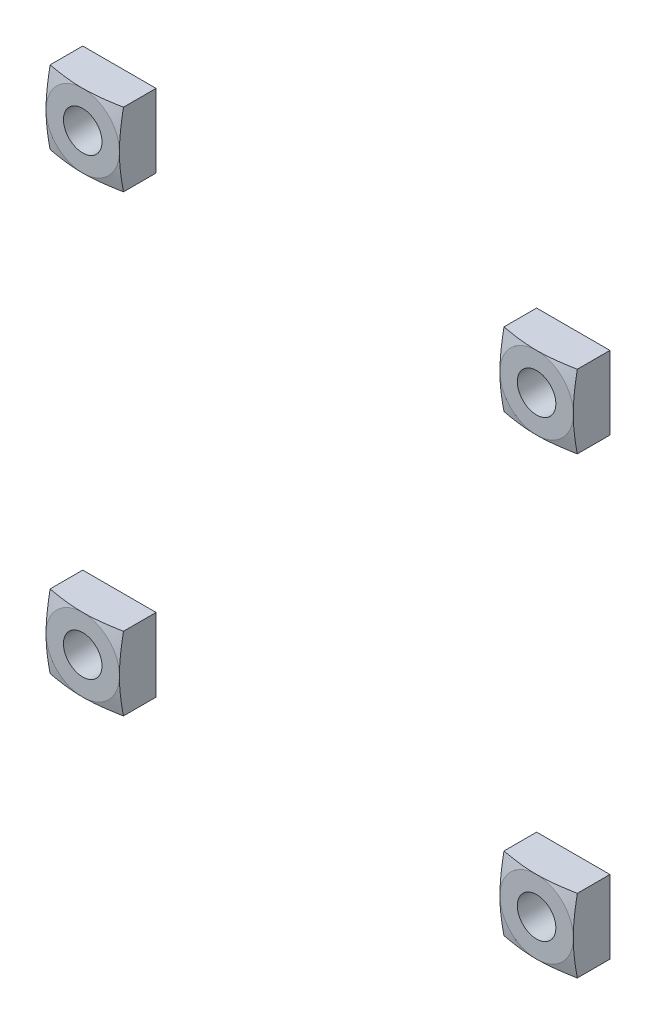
ISO-10303-21;
HEADER;
FILE_DESCRIPTION(('STEP AP214'),'2;1');
FILE_NAME('part.step','',(''),(''),'','','');
FILE_SCHEMA(('AUTOMOTIVE_DESIGN { 1 0 10303 214 1 1 1 1 }'));
ENDSEC;
DATA;
#1=APPLICATION_CONTEXT('core data for automotive mechanical design processes');
#2=APPLICATION_PROTOCOL_DEFINITION('international standard','automotive_design',2000,#1);
#3=PRODUCT_CONTEXT('',#1,'mechanical');
#4=PRODUCT('Part','Part','',(#3));
#5=PRODUCT_RELATED_PRODUCT_CATEGORY('part','',(#4));
#6=PRODUCT_DEFINITION_FORMATION('','',#4);
#7=PRODUCT_DEFINITION_CONTEXT('part definition',#1,'design');
#8=PRODUCT_DEFINITION('design','',#6,#7);
#9=PRODUCT_DEFINITION_SHAPE('','',#8);
#10=(LENGTH_UNIT() NAMED_UNIT(*) SI_UNIT(.MILLI.,.METRE.));
#11=(NAMED_UNIT(*) PLANE_ANGLE_UNIT() SI_UNIT($,.RADIAN.));
#12=(NAMED_UNIT(*) SI_UNIT($,.STERADIAN.) SOLID_ANGLE_UNIT());
#13=UNCERTAINTY_MEASURE_WITH_UNIT(LENGTH_MEASURE(1.E-05),#10,'distance_accuracy_value','');
#14=(GEOMETRIC_REPRESENTATION_CONTEXT(3) GLOBAL_UNCERTAINTY_ASSIGNED_CONTEXT((#13)) GLOBAL_UNIT_ASSIGNED_CONTEXT((#10,
#11,#12)) REPRESENTATION_CONTEXT('',''));
#15=CARTESIAN_POINT('',(0.,0.,0.));
#16=DIRECTION('',(0.,0.,1.));
#17=DIRECTION('',(1.,0.,0.));
#18=AXIS2_PLACEMENT_3D('',#15,#16,#17);
#19=CARTESIAN_POINT('',(-28.7486878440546,104.243567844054,28.27274));
#20=DIRECTION('',(0.,-1.,0.));
#21=DIRECTION('',(1.,0.,0.));
#22=AXIS2_PLACEMENT_3D('',#19,#20,#21);
#23=PLANE('',#22);
#24=DIRECTION('',(0.,0.,1.));
#25=VECTOR('',#24,1.);
#26=CARTESIAN_POINT('',(-20.7486878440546,104.243567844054,28.27274));
#27=LINE('',#26,#25);
#28=CARTESIAN_POINT('',(-20.7486878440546,104.243567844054,28.27274));
#29=VERTEX_POINT('',#28);
#30=CARTESIAN_POINT('',(-20.7486878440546,104.243567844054,31.8287872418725));
#31=VERTEX_POINT('',#30);
#32=EDGE_CURVE('P0_E153',#29,#31,#27,.T.);
#33=ORIENTED_EDGE('',*,*,#32,.T.);
#34=CARTESIAN_POINT('',(-32.8209045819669,104.243567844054,30.9306032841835));
#35=CARTESIAN_POINT('',(-32.612576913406,104.243567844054,30.9806123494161));
#36=CARTESIAN_POINT('',(-32.4041653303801,104.243567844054,31.0302754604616));
#37=CARTESIAN_POINT('',(-31.9871311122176,104.243567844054,31.1287219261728));
#38=CARTESIAN_POINT('',(-31.7785084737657,104.243567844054,31.1775052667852));
#39=CARTESIAN_POINT('',(-31.3610662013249,104.243567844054,31.273991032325));
#40=CARTESIAN_POINT('',(-31.1522466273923,104.243567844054,31.3216937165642));
#41=CARTESIAN_POINT('',(-30.7343086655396,104.243567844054,31.4157717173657));
#42=CARTESIAN_POINT('',(-30.5251902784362,104.243567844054,31.4621470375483));
#43=CARTESIAN_POINT('',(-30.1076789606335,104.243567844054,31.5529999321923));
#44=CARTESIAN_POINT('',(-29.8992879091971,104.243567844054,31.5974861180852));
#45=CARTESIAN_POINT('',(-29.482073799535,104.243567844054,31.6843821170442));
#46=CARTESIAN_POINT('',(-29.2732507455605,104.243567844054,31.7267919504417));
#47=CARTESIAN_POINT('',(-28.8549548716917,104.243567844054,31.8089940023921));
#48=CARTESIAN_POINT('',(-28.645481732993,104.243567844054,31.8487846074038));
#49=CARTESIAN_POINT('',(-28.2259144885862,104.243567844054,31.9249798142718));
#50=CARTESIAN_POINT('',(-28.01582037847,104.243567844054,31.9613843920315));
#51=CARTESIAN_POINT('',(-27.5922792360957,104.243567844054,32.0302918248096));
#52=CARTESIAN_POINT('',(-27.3788232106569,104.243567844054,32.0627399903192));
#53=CARTESIAN_POINT('',(-26.9511184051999,104.243567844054,32.1219947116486));
#54=CARTESIAN_POINT('',(-26.7368696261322,104.243567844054,32.1488012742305));
#55=CARTESIAN_POINT('',(-26.3078777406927,104.243567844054,32.1953900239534));
#56=CARTESIAN_POINT('',(-26.0931356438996,104.243567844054,32.2151813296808));
#57=CARTESIAN_POINT('',(-25.6630438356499,104.243567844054,32.2464914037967));
#58=CARTESIAN_POINT('',(-25.4476941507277,104.243567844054,32.2580105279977));
#59=CARTESIAN_POINT('',(-25.0158173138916,104.243567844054,32.2718942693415));
#60=CARTESIAN_POINT('',(-24.799288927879,104.243567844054,32.2742215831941));
#61=CARTESIAN_POINT('',(-24.3663388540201,104.243567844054,32.2694161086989));
#62=CARTESIAN_POINT('',(-24.1499171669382,104.243567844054,32.2622832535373));
#63=CARTESIAN_POINT('',(-23.7172966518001,104.243567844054,32.2391458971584));
#64=CARTESIAN_POINT('',(-23.5010984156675,104.243567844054,32.2231306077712));
#65=CARTESIAN_POINT('',(-23.0694267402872,104.243567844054,32.1833923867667));
#66=CARTESIAN_POINT('',(-22.8539533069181,104.243567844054,32.1596693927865));
#67=CARTESIAN_POINT('',(-22.3285632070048,104.243567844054,32.0940009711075));
#68=CARTESIAN_POINT('',(-22.01907857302,104.243567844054,32.0486381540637));
#69=CARTESIAN_POINT('',(-21.4016068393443,104.243567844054,31.9485638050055));
#70=CARTESIAN_POINT('',(-21.0936200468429,104.243567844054,31.8938504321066));
#71=CARTESIAN_POINT('',(-20.4786903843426,104.243567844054,31.7778884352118));
#72=CARTESIAN_POINT('',(-20.1717483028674,104.243567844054,31.7166356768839));
#73=CARTESIAN_POINT('',(-19.5588395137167,104.243567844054,31.5895843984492));
#74=CARTESIAN_POINT('',(-19.2528727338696,104.243567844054,31.5237862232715));
#75=CARTESIAN_POINT('',(-18.6409748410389,104.243567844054,31.3888016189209));
#76=CARTESIAN_POINT('',(-18.3350453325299,104.243567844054,31.3196079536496));
#77=CARTESIAN_POINT('',(-17.7237279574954,104.243567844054,31.1788564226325));
#78=CARTESIAN_POINT('',(-17.4183400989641,104.243567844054,31.1072985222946));
#79=CARTESIAN_POINT('',(-16.8080992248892,104.243567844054,30.962456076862));
#80=CARTESIAN_POINT('',(-16.5032460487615,104.243567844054,30.8891722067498));
#81=CARTESIAN_POINT('',(-15.8938630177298,104.243567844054,30.7412709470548));
#82=CARTESIAN_POINT('',(-15.5893331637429,104.243567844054,30.6666535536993));
#83=CARTESIAN_POINT('',(-14.6801413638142,104.243567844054,30.4422660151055));
#84=CARTESIAN_POINT('',(-14.0758501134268,104.243567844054,30.2909950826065));
#85=CARTESIAN_POINT('',(-12.8678337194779,104.243567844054,29.9859192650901));
#86=CARTESIAN_POINT('',(-12.2641086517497,104.243567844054,29.8321140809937));
#87=CARTESIAN_POINT('',(-11.0599447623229,104.243567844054,29.5235527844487));
#88=CARTESIAN_POINT('',(-10.4595039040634,104.243567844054,29.3688046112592));
#89=CARTESIAN_POINT('',(-9.2590098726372,104.243567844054,29.0581277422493));
#90=CARTESIAN_POINT('',(-8.65895665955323,104.243567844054,28.9021992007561));
#91=CARTESIAN_POINT('',(-8.05900019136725,104.243567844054,28.7459035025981));
#92=B_SPLINE_CURVE_WITH_KNOTS('',3,(#34,#35,#36,#37,#38,#39,#40,#41,#42,#43,#44,#45,#46,#47,#48,
#49,#50,#51,#52,#53,#54,#55,#56,#57,#58,#59,#60,#61,#62,#63,#64,#65,#66,#67,#68,#69,#70,#71,#72,
#73,#74,#75,#76,#77,#78,#79,#80,#81,#82,#83,#84,#85,#86,#87,#88,#89,#90,#91),.UNSPECIFIED.,.F.,
.F.,(4,2,2,2,2,2,2,2,2,2,2,2,2,2,2,2,2,2,2,2,2,2,2,2,2,2,2,2,4),(0.,0.642738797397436,
1.28548785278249,1.92808100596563,2.57067240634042,3.20992362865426,3.84916859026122,
4.48880373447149,5.12844343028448,5.77610915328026,6.42377409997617,7.07059408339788,
7.71738624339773,8.36680061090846,9.01621956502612,9.66642900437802,10.3166437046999,
11.254795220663,12.1931316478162,13.1320648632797,14.0709269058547,15.0118848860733,
15.9528566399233,16.8934663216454,17.8340786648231,19.7028801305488,21.5719037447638,
23.4320866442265,25.2920303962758),.UNSPECIFIED.);
#93=CARTESIAN_POINT('',(-24.7486878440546,104.243567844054,32.27274));
#94=VERTEX_POINT('',#93);
#95=EDGE_CURVE('P0_E95',#31,#94,#92,.F.);
#96=ORIENTED_EDGE('',*,*,#95,.T.);
#97=CARTESIAN_POINT('',(-28.7486878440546,104.243567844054,31.8287872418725));
#98=VERTEX_POINT('',#97);
#99=EDGE_CURVE('P0_E85',#94,#98,#92,.F.);
#100=ORIENTED_EDGE('',*,*,#99,.T.);
#101=DIRECTION('',(0.,0.,1.));
#102=VECTOR('',#101,1.);
#103=CARTESIAN_POINT('',(-28.7486878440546,104.243567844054,28.27274));
#104=LINE('',#103,#102);
#105=CARTESIAN_POINT('',(-28.7486878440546,104.243567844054,28.27274));
#106=VERTEX_POINT('',#105);
#107=EDGE_CURVE('P0_E89',#106,#98,#104,.T.);
#108=ORIENTED_EDGE('',*,*,#107,.F.);
#109=DIRECTION('',(1.,0.,0.));
#110=VECTOR('',#109,1.);
#111=CARTESIAN_POINT('',(-28.7486878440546,104.243567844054,28.27274));
#112=LINE('',#111,#110);
#113=EDGE_CURVE('P0_E155',#106,#29,#112,.T.);
#114=ORIENTED_EDGE('',*,*,#113,.T.);
#115=EDGE_LOOP('',(#33,#96,#100,#108,#114));
#116=FACE_BOUND('',#115,.T.);
#117=ADVANCED_FACE('P0_F16',(#116),#23,.T.);
#118=CARTESIAN_POINT('',(-28.7486878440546,112.243567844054,28.27274));
#119=DIRECTION('',(-1.,0.,0.));
#120=DIRECTION('',(0.,-1.,0.));
#121=AXIS2_PLACEMENT_3D('',#118,#119,#120);
#122=PLANE('',#121);
#123=ORIENTED_EDGE('',*,*,#107,.T.);
#124=CARTESIAN_POINT('',(-28.7486878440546,100.171351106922,30.9306032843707));
#125=CARTESIAN_POINT('',(-28.7486878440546,100.37967877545,30.9806123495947));
#126=CARTESIAN_POINT('',(-28.7486878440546,100.588090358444,31.0302754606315));
#127=CARTESIAN_POINT('',(-28.7486878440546,101.005124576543,31.1287219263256));
#128=CARTESIAN_POINT('',(-28.7486878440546,101.213747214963,31.1775052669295));
#129=CARTESIAN_POINT('',(-28.7486878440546,101.63118948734,31.2739910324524));
#130=CARTESIAN_POINT('',(-28.7486878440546,101.84000906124,31.3216937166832));
#131=CARTESIAN_POINT('',(-28.7486878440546,102.257947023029,31.4157717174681));
#132=CARTESIAN_POINT('',(-28.7486878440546,102.4670654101,31.4621470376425));
#133=CARTESIAN_POINT('',(-28.7486878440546,102.884576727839,31.5529999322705));
#134=CARTESIAN_POINT('',(-28.7486878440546,103.092967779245,31.5974861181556));
#135=CARTESIAN_POINT('',(-28.7486878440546,103.510181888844,31.6843821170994));
#136=CARTESIAN_POINT('',(-28.7486878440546,103.719004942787,31.7267919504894));
#137=CARTESIAN_POINT('',(-28.7486878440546,104.137300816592,31.8089940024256));
#138=CARTESIAN_POINT('',(-28.7486878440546,104.346773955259,31.8487846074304));
#139=CARTESIAN_POINT('',(-28.7486878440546,104.766341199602,31.9249798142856));
#140=CARTESIAN_POINT('',(-28.7486878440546,104.976435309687,31.9613843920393));
#141=CARTESIAN_POINT('',(-28.7486878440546,105.399976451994,32.0302918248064));
#142=CARTESIAN_POINT('',(-28.7486878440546,105.613432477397,32.0627399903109));
#143=CARTESIAN_POINT('',(-28.7486878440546,106.041137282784,32.1219947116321));
#144=CARTESIAN_POINT('',(-28.7486878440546,106.255386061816,32.1488012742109));
#145=CARTESIAN_POINT('',(-28.7486878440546,106.684377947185,32.1953900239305));
#146=CARTESIAN_POINT('',(-28.7486878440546,106.899120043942,32.2151813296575));
#147=CARTESIAN_POINT('',(-28.7486878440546,107.329211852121,32.246491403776));
#148=CARTESIAN_POINT('',(-28.7486878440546,107.544561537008,32.2580105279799));
#149=CARTESIAN_POINT('',(-28.7486878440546,107.976438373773,32.271894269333));
#150=CARTESIAN_POINT('',(-28.7486878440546,108.19296675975,32.274221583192));
#151=CARTESIAN_POINT('',(-28.7486878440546,108.625916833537,32.2694161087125));
#152=CARTESIAN_POINT('',(-28.7486878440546,108.842338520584,32.2622832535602));
#153=CARTESIAN_POINT('',(-28.7486878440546,109.274959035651,32.239145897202));
#154=CARTESIAN_POINT('',(-28.7486878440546,109.491157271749,32.2231306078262));
#155=CARTESIAN_POINT('',(-28.7486878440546,109.922828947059,32.1833923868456));
#156=CARTESIAN_POINT('',(-28.7486878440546,110.138302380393,32.1596693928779));
#157=CARTESIAN_POINT('',(-28.7486878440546,110.663692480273,32.0940009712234));
#158=CARTESIAN_POINT('',(-28.7486878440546,110.973177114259,32.0486381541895));
#159=CARTESIAN_POINT('',(-28.7486878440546,111.590648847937,31.9485638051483));
#160=CARTESIAN_POINT('',(-28.7486878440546,111.898635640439,31.8938504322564));
#161=CARTESIAN_POINT('',(-28.7486878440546,112.513565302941,31.7778884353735));
#162=CARTESIAN_POINT('',(-28.7486878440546,112.820507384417,31.7166356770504));
#163=CARTESIAN_POINT('',(-28.7486878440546,113.433416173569,31.589584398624));
#164=CARTESIAN_POINT('',(-28.7486878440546,113.739382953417,31.5237862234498));
#165=CARTESIAN_POINT('',(-28.7486878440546,114.351280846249,31.388801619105));
#166=CARTESIAN_POINT('',(-28.7486878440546,114.65721035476,31.3196079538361));
#167=CARTESIAN_POINT('',(-28.7486878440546,115.268527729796,31.1788564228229));
#168=CARTESIAN_POINT('',(-28.7486878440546,115.573915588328,31.1072985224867));
#169=CARTESIAN_POINT('',(-28.7486878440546,116.184156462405,30.962456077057));
#170=CARTESIAN_POINT('',(-28.7486878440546,116.489009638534,30.889172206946));
#171=CARTESIAN_POINT('',(-28.7486878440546,117.098392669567,30.7412709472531));
#172=CARTESIAN_POINT('',(-28.7486878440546,117.402922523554,30.6666535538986));
#173=CARTESIAN_POINT('',(-28.7486878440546,118.312114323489,30.4422660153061));
#174=CARTESIAN_POINT('',(-28.7486878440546,118.916405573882,30.2909950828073));
#175=CARTESIAN_POINT('',(-28.7486878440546,120.124421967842,29.9859192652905));
#176=CARTESIAN_POINT('',(-28.7486878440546,120.728147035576,29.8321140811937));
#177=CARTESIAN_POINT('',(-28.7486878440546,121.932310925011,29.5235527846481));
#178=CARTESIAN_POINT('',(-28.7486878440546,122.532751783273,29.3688046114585));
#179=CARTESIAN_POINT('',(-28.7486878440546,123.733245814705,29.0581277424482));
#180=CARTESIAN_POINT('',(-28.7486878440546,124.333299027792,28.9021992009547));
#181=CARTESIAN_POINT('',(-28.7486878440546,124.933255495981,28.7459035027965));
#182=B_SPLINE_CURVE_WITH_KNOTS('',3,(#124,#125,#126,#127,#128,#129,#130,#131,#132,#133,#134,
#135,#136,#137,#138,#139,#140,#141,#142,#143,#144,#145,#146,#147,#148,#149,#150,#151,#152,#153,
#154,#155,#156,#157,#158,#159,#160,#161,#162,#163,#164,#165,#166,#167,#168,#169,#170,#171,#172,
#173,#174,#175,#176,#177,#178,#179,#180,#181),.UNSPECIFIED.,.F.,.F.,(4,2,2,2,2,2,2,2,2,2,2,2,2,
2,2,2,2,2,2,2,2,2,2,2,2,2,2,2,4),(0.,0.642738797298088,1.28548785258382,1.92808100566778,
2.57067240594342,3.20992362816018,3.84916858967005,4.48880373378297,5.1284434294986,
5.77610915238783,6.42377409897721,7.07059408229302,7.71738624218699,8.3668006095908,
9.01621956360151,9.66642900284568,10.3166437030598,11.2547952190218,12.1931316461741,
13.132064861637,14.0709269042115,15.0118848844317,15.9528566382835,16.8934663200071,
17.8340786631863,19.7028801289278,21.5719037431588,23.4320866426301,25.2920303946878),.UNSPECIFIED.);
#183=CARTESIAN_POINT('',(-28.7486878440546,108.243567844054,32.27274));
#184=VERTEX_POINT('',#183);
#185=EDGE_CURVE('P0_E78',#98,#184,#182,.T.);
#186=ORIENTED_EDGE('',*,*,#185,.T.);
#187=CARTESIAN_POINT('',(-28.7486878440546,112.243567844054,31.8287872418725));
#188=VERTEX_POINT('',#187);
#189=EDGE_CURVE('P0_E68',#184,#188,#182,.T.);
#190=ORIENTED_EDGE('',*,*,#189,.T.);
#191=DIRECTION('',(0.,0.,1.));
#192=VECTOR('',#191,1.);
#193=CARTESIAN_POINT('',(-28.7486878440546,112.243567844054,28.27274));
#194=LINE('',#193,#192);
#195=CARTESIAN_POINT('',(-28.7486878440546,112.243567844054,28.27274));
#196=VERTEX_POINT('',#195);
#197=EDGE_CURVE('P0_E161',#196,#188,#194,.T.);
#198=ORIENTED_EDGE('',*,*,#197,.F.);
#199=DIRECTION('',(0.,-1.,0.));
#200=VECTOR('',#199,1.);
#201=CARTESIAN_POINT('',(-28.7486878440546,112.243567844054,28.27274));
#202=LINE('',#201,#200);
#203=EDGE_CURVE('P0_E159',#196,#106,#202,.T.);
#204=ORIENTED_EDGE('',*,*,#203,.T.);
#205=EDGE_LOOP('',(#123,#186,#190,#198,#204));
#206=FACE_BOUND('',#205,.T.);
#207=ADVANCED_FACE('P0_F93',(#206),#122,.T.);
#208=CARTESIAN_POINT('',(-20.7486878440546,112.243567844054,28.27274));
#209=DIRECTION('',(0.,1.,0.));
#210=DIRECTION('',(-1.,0.,0.));
#211=AXIS2_PLACEMENT_3D('',#208,#209,#210);
#212=PLANE('',#211);
#213=ORIENTED_EDGE('',*,*,#197,.T.);
#214=CARTESIAN_POINT('',(-32.8209045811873,112.243567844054,30.9306032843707));
#215=CARTESIAN_POINT('',(-32.6125769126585,112.243567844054,30.9806123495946));
#216=CARTESIAN_POINT('',(-32.4041653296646,112.243567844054,31.0302754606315));
#217=CARTESIAN_POINT('',(-31.987131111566,112.243567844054,31.1287219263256));
#218=CARTESIAN_POINT('',(-31.7785084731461,112.243567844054,31.1775052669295));
#219=CARTESIAN_POINT('',(-31.3610662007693,112.243567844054,31.2739910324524));
#220=CARTESIAN_POINT('',(-31.1522466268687,112.243567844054,31.3216937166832));
#221=CARTESIAN_POINT('',(-30.73430866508,112.243567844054,31.4157717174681));
#222=CARTESIAN_POINT('',(-30.5251902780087,112.243567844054,31.4621470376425));
#223=CARTESIAN_POINT('',(-30.1076789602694,112.243567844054,31.5529999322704));
#224=CARTESIAN_POINT('',(-29.8992879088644,112.243567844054,31.5974861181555));
#225=CARTESIAN_POINT('',(-29.4820737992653,112.243567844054,31.6843821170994));
#226=CARTESIAN_POINT('',(-29.2732507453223,112.243567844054,31.7267919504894));
#227=CARTESIAN_POINT('',(-28.8549548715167,112.243567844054,31.8089940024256));
#228=CARTESIAN_POINT('',(-28.6454817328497,112.243567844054,31.8487846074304));
#229=CARTESIAN_POINT('',(-28.2259144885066,112.243567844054,31.9249798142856));
#230=CARTESIAN_POINT('',(-28.0158203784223,112.243567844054,31.9613843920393));
#231=CARTESIAN_POINT('',(-27.592279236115,112.243567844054,32.0302918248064));
#232=CARTESIAN_POINT('',(-27.3788232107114,112.243567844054,32.0627399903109));
#233=CARTESIAN_POINT('',(-26.951118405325,112.243567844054,32.1219947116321));
#234=CARTESIAN_POINT('',(-26.7368696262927,112.243567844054,32.1488012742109));
#235=CARTESIAN_POINT('',(-26.3078777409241,112.243567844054,32.1953900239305));
#236=CARTESIAN_POINT('',(-26.0931356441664,112.243567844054,32.2151813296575));
#237=CARTESIAN_POINT('',(-25.6630438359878,112.243567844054,32.246491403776));
#238=CARTESIAN_POINT('',(-25.4476941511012,112.243567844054,32.2580105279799));
#239=CARTESIAN_POINT('',(-25.0158173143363,112.243567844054,32.271894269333));
#240=CARTESIAN_POINT('',(-24.7992889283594,112.243567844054,32.274221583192));
#241=CARTESIAN_POINT('',(-24.3663388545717,112.243567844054,32.2694161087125));
#242=CARTESIAN_POINT('',(-24.1499171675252,112.243567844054,32.2622832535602));
#243=CARTESIAN_POINT('',(-23.7172966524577,112.243567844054,32.239145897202));
#244=CARTESIAN_POINT('',(-23.5010984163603,112.243567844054,32.2231306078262));
#245=CARTESIAN_POINT('',(-23.06942674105,112.243567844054,32.1833923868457));
#246=CARTESIAN_POINT('',(-22.8539533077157,112.243567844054,32.1596693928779));
#247=CARTESIAN_POINT('',(-22.3285632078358,112.243567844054,32.0940009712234));
#248=CARTESIAN_POINT('',(-22.0190785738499,112.243567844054,32.0486381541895));
#249=CARTESIAN_POINT('',(-21.4016068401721,112.243567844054,31.9485638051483));
#250=CARTESIAN_POINT('',(-21.0936200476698,112.243567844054,31.8938504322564));
#251=CARTESIAN_POINT('',(-20.4786903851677,112.243567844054,31.7778884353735));
#252=CARTESIAN_POINT('',(-20.1717483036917,112.243567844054,31.7166356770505));
#253=CARTESIAN_POINT('',(-19.5588395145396,112.243567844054,31.589584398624));
#254=CARTESIAN_POINT('',(-19.252872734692,112.243567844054,31.5237862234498));
#255=CARTESIAN_POINT('',(-18.6409748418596,112.243567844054,31.388801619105));
#256=CARTESIAN_POINT('',(-18.3350453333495,112.243567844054,31.3196079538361));
#257=CARTESIAN_POINT('',(-17.7237279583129,112.243567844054,31.178856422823));
#258=CARTESIAN_POINT('',(-17.4183400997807,112.243567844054,31.1072985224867));
#259=CARTESIAN_POINT('',(-16.8080992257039,112.243567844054,30.9624560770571));
#260=CARTESIAN_POINT('',(-16.5032460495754,112.243567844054,30.8891722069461));
#261=CARTESIAN_POINT('',(-15.8938630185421,112.243567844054,30.7412709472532));
#262=CARTESIAN_POINT('',(-15.5893331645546,112.243567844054,30.6666535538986));
#263=CARTESIAN_POINT('',(-14.6801413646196,112.243567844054,30.4422660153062));
#264=CARTESIAN_POINT('',(-14.0758501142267,112.243567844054,30.2909950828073));
#265=CARTESIAN_POINT('',(-12.867833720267,112.243567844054,29.9859192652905));
#266=CARTESIAN_POINT('',(-12.2641086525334,112.243567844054,29.8321140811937));
#267=CARTESIAN_POINT('',(-11.0599447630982,112.243567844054,29.5235527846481));
#268=CARTESIAN_POINT('',(-10.4595039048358,112.243567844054,29.3688046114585));
#269=CARTESIAN_POINT('',(-9.25900987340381,112.243567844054,29.0581277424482));
#270=CARTESIAN_POINT('',(-8.65895666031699,112.243567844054,28.9021992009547));
#271=CARTESIAN_POINT('',(-8.05900019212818,112.243567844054,28.7459035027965));
#272=B_SPLINE_CURVE_WITH_KNOTS('',3,(#214,#215,#216,#217,#218,#219,#220,#221,#222,#223,#224,
#225,#226,#227,#228,#229,#230,#231,#232,#233,#234,#235,#236,#237,#238,#239,#240,#241,#242,#243,
#244,#245,#246,#247,#248,#249,#250,#251,#252,#253,#254,#255,#256,#257,#258,#259,#260,#261,#262,
#263,#264,#265,#266,#267,#268,#269,#270,#271),.UNSPECIFIED.,.F.,.F.,(4,2,2,2,2,2,2,2,2,2,2,2,2,
2,2,2,2,2,2,2,2,2,2,2,2,2,2,2,4),(0.,0.642738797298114,1.28548785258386,1.92808100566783,
2.57067240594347,3.20992362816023,3.84916858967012,4.48880373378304,5.1284434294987,
5.77610915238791,6.42377409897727,7.07059408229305,7.717386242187,8.36680060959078,
9.01621956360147,9.66642900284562,10.3166437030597,11.2547952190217,12.193131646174,
13.1320648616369,14.0709269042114,15.0118848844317,15.9528566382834,16.893466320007,
17.8340786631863,19.7028801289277,21.5719037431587,23.4320866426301,25.2920303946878),.UNSPECIFIED.);
#273=CARTESIAN_POINT('',(-24.7486878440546,112.243567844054,32.27274));
#274=VERTEX_POINT('',#273);
#275=EDGE_CURVE('P0_E74',#188,#274,#272,.T.);
#276=ORIENTED_EDGE('',*,*,#275,.T.);
#277=CARTESIAN_POINT('',(-20.7486878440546,112.243567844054,31.8287872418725));
#278=VERTEX_POINT('',#277);
#279=EDGE_CURVE('P0_E32',#274,#278,#272,.T.);
#280=ORIENTED_EDGE('',*,*,#279,.T.);
#281=DIRECTION('',(0.,0.,1.));
#282=VECTOR('',#281,1.);
#283=CARTESIAN_POINT('',(-20.7486878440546,112.243567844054,28.27274));
#284=LINE('',#283,#282);
#285=CARTESIAN_POINT('',(-20.7486878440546,112.243567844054,28.27274));
#286=VERTEX_POINT('',#285);
#287=EDGE_CURVE('P0_E158',#286,#278,#284,.T.);
#288=ORIENTED_EDGE('',*,*,#287,.F.);
#289=DIRECTION('',(-1.,0.,0.));
#290=VECTOR('',#289,1.);
#291=CARTESIAN_POINT('',(-20.7486878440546,112.243567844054,28.27274));
#292=LINE('',#291,#290);
#293=EDGE_CURVE('P0_E163',#286,#196,#292,.T.);
#294=ORIENTED_EDGE('',*,*,#293,.T.);
#295=EDGE_LOOP('',(#213,#276,#280,#288,#294));
#296=FACE_BOUND('',#295,.T.);
#297=ADVANCED_FACE('P0_F136',(#296),#212,.T.);
#298=CARTESIAN_POINT('',(-20.7486878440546,104.243567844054,28.27274));
#299=DIRECTION('',(1.,0.,0.));
#300=DIRECTION('',(0.,1.,0.));
#301=AXIS2_PLACEMENT_3D('',#298,#299,#300);
#302=PLANE('',#301);
#303=ORIENTED_EDGE('',*,*,#287,.T.);
#304=CARTESIAN_POINT('',(-20.7486878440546,100.171351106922,30.9306032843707));
#305=CARTESIAN_POINT('',(-20.7486878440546,100.37967877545,30.9806123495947));
#306=CARTESIAN_POINT('',(-20.7486878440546,100.588090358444,31.0302754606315));
#307=CARTESIAN_POINT('',(-20.7486878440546,101.005124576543,31.1287219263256));
#308=CARTESIAN_POINT('',(-20.7486878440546,101.213747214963,31.1775052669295));
#309=CARTESIAN_POINT('',(-20.7486878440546,101.63118948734,31.2739910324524));
#310=CARTESIAN_POINT('',(-20.7486878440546,101.84000906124,31.3216937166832));
#311=CARTESIAN_POINT('',(-20.7486878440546,102.257947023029,31.4157717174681));
#312=CARTESIAN_POINT('',(-20.7486878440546,102.4670654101,31.4621470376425));
#313=CARTESIAN_POINT('',(-20.7486878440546,102.884576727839,31.5529999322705));
#314=CARTESIAN_POINT('',(-20.7486878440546,103.092967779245,31.5974861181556));
#315=CARTESIAN_POINT('',(-20.7486878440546,103.510181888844,31.6843821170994));
#316=CARTESIAN_POINT('',(-20.7486878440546,103.719004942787,31.7267919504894));
#317=CARTESIAN_POINT('',(-20.7486878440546,104.137300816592,31.8089940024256));
#318=CARTESIAN_POINT('',(-20.7486878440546,104.346773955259,31.8487846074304));
#319=CARTESIAN_POINT('',(-20.7486878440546,104.766341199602,31.9249798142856));
#320=CARTESIAN_POINT('',(-20.7486878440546,104.976435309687,31.9613843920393));
#321=CARTESIAN_POINT('',(-20.7486878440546,105.399976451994,32.0302918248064));
#322=CARTESIAN_POINT('',(-20.7486878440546,105.613432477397,32.0627399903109));
#323=CARTESIAN_POINT('',(-20.7486878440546,106.041137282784,32.1219947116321));
#324=CARTESIAN_POINT('',(-20.7486878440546,106.255386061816,32.1488012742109));
#325=CARTESIAN_POINT('',(-20.7486878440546,106.684377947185,32.1953900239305));
#326=CARTESIAN_POINT('',(-20.7486878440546,106.899120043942,32.2151813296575));
#327=CARTESIAN_POINT('',(-20.7486878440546,107.329211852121,32.246491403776));
#328=CARTESIAN_POINT('',(-20.7486878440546,107.544561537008,32.2580105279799));
#329=CARTESIAN_POINT('',(-20.7486878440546,107.976438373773,32.271894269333));
#330=CARTESIAN_POINT('',(-20.7486878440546,108.19296675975,32.274221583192));
#331=CARTESIAN_POINT('',(-20.7486878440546,108.625916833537,32.2694161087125));
#332=CARTESIAN_POINT('',(-20.7486878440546,108.842338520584,32.2622832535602));
#333=CARTESIAN_POINT('',(-20.7486878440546,109.274959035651,32.239145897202));
#334=CARTESIAN_POINT('',(-20.7486878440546,109.491157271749,32.2231306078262));
#335=CARTESIAN_POINT('',(-20.7486878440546,109.922828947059,32.1833923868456));
#336=CARTESIAN_POINT('',(-20.7486878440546,110.138302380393,32.1596693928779));
#337=CARTESIAN_POINT('',(-20.7486878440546,110.663692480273,32.0940009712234));
#338=CARTESIAN_POINT('',(-20.7486878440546,110.973177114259,32.0486381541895));
#339=CARTESIAN_POINT('',(-20.7486878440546,111.590648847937,31.9485638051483));
#340=CARTESIAN_POINT('',(-20.7486878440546,111.898635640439,31.8938504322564));
#341=CARTESIAN_POINT('',(-20.7486878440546,112.513565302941,31.7778884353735));
#342=CARTESIAN_POINT('',(-20.7486878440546,112.820507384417,31.7166356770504));
#343=CARTESIAN_POINT('',(-20.7486878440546,113.433416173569,31.589584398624));
#344=CARTESIAN_POINT('',(-20.7486878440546,113.739382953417,31.5237862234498));
#345=CARTESIAN_POINT('',(-20.7486878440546,114.351280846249,31.388801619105));
#346=CARTESIAN_POINT('',(-20.7486878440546,114.65721035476,31.3196079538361));
#347=CARTESIAN_POINT('',(-20.7486878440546,115.268527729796,31.1788564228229));
#348=CARTESIAN_POINT('',(-20.7486878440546,115.573915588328,31.1072985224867));
#349=CARTESIAN_POINT('',(-20.7486878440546,116.184156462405,30.962456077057));
#350=CARTESIAN_POINT('',(-20.7486878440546,116.489009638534,30.889172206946));
#351=CARTESIAN_POINT('',(-20.7486878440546,117.098392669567,30.7412709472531));
#352=CARTESIAN_POINT('',(-20.7486878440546,117.402922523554,30.6666535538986));
#353=CARTESIAN_POINT('',(-20.7486878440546,118.312114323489,30.4422660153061));
#354=CARTESIAN_POINT('',(-20.7486878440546,118.916405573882,30.2909950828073));
#355=CARTESIAN_POINT('',(-20.7486878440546,120.124421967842,29.9859192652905));
#356=CARTESIAN_POINT('',(-20.7486878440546,120.728147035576,29.8321140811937));
#357=CARTESIAN_POINT('',(-20.7486878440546,121.932310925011,29.5235527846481));
#358=CARTESIAN_POINT('',(-20.7486878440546,122.532751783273,29.3688046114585));
#359=CARTESIAN_POINT('',(-20.7486878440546,123.733245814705,29.0581277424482));
#360=CARTESIAN_POINT('',(-20.7486878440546,124.333299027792,28.9021992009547));
#361=CARTESIAN_POINT('',(-20.7486878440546,124.933255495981,28.7459035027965));
#362=B_SPLINE_CURVE_WITH_KNOTS('',3,(#304,#305,#306,#307,#308,#309,#310,#311,#312,#313,#314,
#315,#316,#317,#318,#319,#320,#321,#322,#323,#324,#325,#326,#327,#328,#329,#330,#331,#332,#333,
#334,#335,#336,#337,#338,#339,#340,#341,#342,#343,#344,#345,#346,#347,#348,#349,#350,#351,#352,
#353,#354,#355,#356,#357,#358,#359,#360,#361),.UNSPECIFIED.,.F.,.F.,(4,2,2,2,2,2,2,2,2,2,2,2,2,
2,2,2,2,2,2,2,2,2,2,2,2,2,2,2,4),(0.,0.642738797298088,1.28548785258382,1.92808100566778,
2.57067240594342,3.20992362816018,3.84916858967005,4.48880373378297,5.1284434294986,
5.77610915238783,6.42377409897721,7.07059408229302,7.71738624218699,8.3668006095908,
9.01621956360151,9.66642900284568,10.3166437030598,11.2547952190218,12.1931316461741,
13.132064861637,14.0709269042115,15.0118848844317,15.9528566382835,16.8934663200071,
17.8340786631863,19.7028801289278,21.5719037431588,23.4320866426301,25.2920303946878),.UNSPECIFIED.);
#363=CARTESIAN_POINT('',(-20.7486878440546,108.243567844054,32.27274));
#364=VERTEX_POINT('',#363);
#365=EDGE_CURVE('P0_E132',#278,#364,#362,.F.);
#366=ORIENTED_EDGE('',*,*,#365,.T.);
#367=EDGE_CURVE('P0_E39',#364,#31,#362,.F.);
#368=ORIENTED_EDGE('',*,*,#367,.T.);
#369=ORIENTED_EDGE('',*,*,#32,.F.);
#370=DIRECTION('',(0.,1.,0.));
#371=VECTOR('',#370,1.);
#372=CARTESIAN_POINT('',(-20.7486878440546,104.243567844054,28.27274));
#373=LINE('',#372,#371);
#374=EDGE_CURVE('P0_E170',#29,#286,#373,.T.);
#375=ORIENTED_EDGE('',*,*,#374,.T.);
#376=EDGE_LOOP('',(#303,#366,#368,#369,#375));
#377=FACE_BOUND('',#376,.T.);
#378=ADVANCED_FACE('P0_F133',(#377),#302,.T.);
#379=CARTESIAN_POINT('',(-28.7486878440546,104.243567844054,32.27274));
#380=DIRECTION('',(0.,0.,-1.));
#381=DIRECTION('',(-1.,0.,0.));
#382=AXIS2_PLACEMENT_3D('',#379,#380,#381);
#383=PLANE('',#382);
#384=CARTESIAN_POINT('',(-24.7486878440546,108.243567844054,32.27274));
#385=DIRECTION('',(0.,0.,1.));
#386=DIRECTION('',(1.,0.,0.));
#387=AXIS2_PLACEMENT_3D('',#384,#385,#386);
#388=CIRCLE('',#387,2.1);
#389=CARTESIAN_POINT('',(-22.6486878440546,108.243567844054,32.27274));
#390=VERTEX_POINT('',#389);
#391=EDGE_CURVE('P0_E174',#390,#390,#388,.T.);
#392=ORIENTED_EDGE('',*,*,#391,.F.);
#393=EDGE_LOOP('',(#392));
#394=FACE_BOUND('',#393,.T.);
#395=CARTESIAN_POINT('',(-24.7486878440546,108.243567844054,32.27274));
#396=DIRECTION('',(0.,0.,-1.));
#397=DIRECTION('',(-1.,0.,0.));
#398=AXIS2_PLACEMENT_3D('',#395,#396,#397);
#399=CIRCLE('',#398,4.);
#400=EDGE_CURVE('P0_E10',#184,#274,#399,.T.);
#401=ORIENTED_EDGE('',*,*,#400,.F.);
#402=EDGE_CURVE('P0_E20',#94,#184,#399,.T.);
#403=ORIENTED_EDGE('',*,*,#402,.F.);
#404=EDGE_CURVE('P0_E25',#364,#94,#399,.T.);
#405=ORIENTED_EDGE('',*,*,#404,.F.);
#406=CARTESIAN_POINT('',(-24.7486878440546,108.243567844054,32.27274));
#407=DIRECTION('',(0.,0.,1.));
#408=DIRECTION('',(1.,0.,0.));
#409=AXIS2_PLACEMENT_3D('',#406,#407,#408);
#410=CIRCLE('',#409,4.);
#411=EDGE_CURVE('P0_E91',#364,#274,#410,.T.);
#412=ORIENTED_EDGE('',*,*,#411,.T.);
#413=EDGE_LOOP('',(#401,#403,#405,#412));
#414=FACE_BOUND('',#413,.T.);
#415=ADVANCED_FACE('P0_F90',(#394,#414),#383,.F.);
#416=CARTESIAN_POINT('',(-28.7486878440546,104.243567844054,28.27274));
#417=DIRECTION('',(0.,0.,-1.));
#418=DIRECTION('',(-1.,0.,0.));
#419=AXIS2_PLACEMENT_3D('',#416,#417,#418);
#420=PLANE('',#419);
#421=CARTESIAN_POINT('',(-24.7486878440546,108.243567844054,28.27274));
#422=DIRECTION('',(0.,0.,1.));
#423=DIRECTION('',(1.,0.,0.));
#424=AXIS2_PLACEMENT_3D('',#421,#422,#423);
#425=CIRCLE('',#424,2.1);
#426=CARTESIAN_POINT('',(-22.6486878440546,108.243567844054,28.27274));
#427=VERTEX_POINT('',#426);
#428=EDGE_CURVE('P0_E173',#427,#427,#425,.T.);
#429=ORIENTED_EDGE('',*,*,#428,.T.);
#430=EDGE_LOOP('',(#429));
#431=FACE_BOUND('',#430,.T.);
#432=ORIENTED_EDGE('',*,*,#113,.F.);
#433=ORIENTED_EDGE('',*,*,#203,.F.);
#434=ORIENTED_EDGE('',*,*,#293,.F.);
#435=ORIENTED_EDGE('',*,*,#374,.F.);
#436=EDGE_LOOP('',(#432,#433,#434,#435));
#437=FACE_BOUND('',#436,.T.);
#438=ADVANCED_FACE('P0_F179',(#431,#437),#420,.T.);
#439=CARTESIAN_POINT('',(-24.7486878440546,108.243567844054,28.27274));
#440=DIRECTION('',(0.,0.,1.));
#441=DIRECTION('',(1.,0.,0.));
#442=AXIS2_PLACEMENT_3D('',#439,#440,#441);
#443=CYLINDRICAL_SURFACE('',#442,2.1);
#444=ORIENTED_EDGE('',*,*,#428,.F.);
#445=EDGE_LOOP('',(#444));
#446=FACE_BOUND('',#445,.T.);
#447=ORIENTED_EDGE('',*,*,#391,.T.);
#448=EDGE_LOOP('',(#447));
#449=FACE_BOUND('',#448,.T.);
#450=ADVANCED_FACE('P0_F122',(#446,#449),#443,.F.);
#451=CARTESIAN_POINT('',(-24.7486878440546,108.243567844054,32.27274));
#452=DIRECTION('',(0.,0.,-1.));
#453=DIRECTION('',(-1.,0.,0.));
#454=AXIS2_PLACEMENT_3D('',#451,#452,#453);
#455=CONICAL_SURFACE('',#454,4.,1.30899693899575);
#456=ORIENTED_EDGE('',*,*,#402,.T.);
#457=ORIENTED_EDGE('',*,*,#185,.F.);
#458=ORIENTED_EDGE('',*,*,#99,.F.);
#459=EDGE_LOOP('',(#456,#457,#458));
#460=FACE_BOUND('',#459,.T.);
#461=ADVANCED_FACE('P0_F83',(#460),#455,.T.);
#462=ORIENTED_EDGE('',*,*,#367,.F.);
#463=ORIENTED_EDGE('',*,*,#404,.T.);
#464=ORIENTED_EDGE('',*,*,#95,.F.);
#465=EDGE_LOOP('',(#462,#463,#464));
#466=FACE_BOUND('',#465,.T.);
#467=ADVANCED_FACE('P0_F121',(#466),#455,.T.);
#468=ORIENTED_EDGE('',*,*,#411,.F.);
#469=ORIENTED_EDGE('',*,*,#365,.F.);
#470=ORIENTED_EDGE('',*,*,#279,.F.);
#471=EDGE_LOOP('',(#468,#469,#470));
#472=FACE_BOUND('',#471,.T.);
#473=ADVANCED_FACE('P0_F117',(#472),#455,.T.);
#474=ORIENTED_EDGE('',*,*,#400,.T.);
#475=ORIENTED_EDGE('',*,*,#275,.F.);
#476=ORIENTED_EDGE('',*,*,#189,.F.);
#477=EDGE_LOOP('',(#474,#475,#476));
#478=FACE_BOUND('',#477,.T.);
#479=ADVANCED_FACE('P0_F70',(#478),#455,.T.);
#480=CLOSED_SHELL('',(#117,#207,#297,#378,#415,#438,#450,#461,#467,#473,#479));
#481=MANIFOLD_SOLID_BREP('P0_B1',#480);
#482=CARTESIAN_POINT('',(-28.7486878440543,54.7461921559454,28.27274));
#483=DIRECTION('',(0.,-1.,0.));
#484=DIRECTION('',(1.,0.,0.));
#485=AXIS2_PLACEMENT_3D('',#482,#483,#484);
#486=PLANE('',#485);
#487=DIRECTION('',(0.,0.,1.));
#488=VECTOR('',#487,1.);
#489=CARTESIAN_POINT('',(-20.7486878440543,54.7461921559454,28.27274));
#490=LINE('',#489,#488);
#491=CARTESIAN_POINT('',(-20.7486878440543,54.7461921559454,28.27274));
#492=VERTEX_POINT('',#491);
#493=CARTESIAN_POINT('',(-20.7486878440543,54.7461921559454,31.8287872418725));
#494=VERTEX_POINT('',#493);
#495=EDGE_CURVE('P1_E170',#492,#494,#490,.T.);
#496=ORIENTED_EDGE('',*,*,#495,.T.);
#497=CARTESIAN_POINT('',(-32.8209045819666,54.7461921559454,30.9306032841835));
#498=CARTESIAN_POINT('',(-32.6125769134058,54.7461921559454,30.9806123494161));
#499=CARTESIAN_POINT('',(-32.4041653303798,54.7461921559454,31.0302754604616));
#500=CARTESIAN_POINT('',(-31.9871311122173,54.7461921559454,31.1287219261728));
#501=CARTESIAN_POINT('',(-31.7785084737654,54.7461921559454,31.1775052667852));
#502=CARTESIAN_POINT('',(-31.3610662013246,54.7461921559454,31.273991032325));
#503=CARTESIAN_POINT('',(-31.152246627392,54.7461921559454,31.3216937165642));
#504=CARTESIAN_POINT('',(-30.7343086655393,54.7461921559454,31.4157717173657));
#505=CARTESIAN_POINT('',(-30.525190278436,54.7461921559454,31.4621470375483));
#506=CARTESIAN_POINT('',(-30.1076789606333,54.7461921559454,31.5529999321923));
#507=CARTESIAN_POINT('',(-29.8992879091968,54.7461921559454,31.5974861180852));
#508=CARTESIAN_POINT('',(-29.4820737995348,54.7461921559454,31.6843821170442));
#509=CARTESIAN_POINT('',(-29.2732507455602,54.7461921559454,31.7267919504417));
#510=CARTESIAN_POINT('',(-28.8549548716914,54.7461921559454,31.8089940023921));
#511=CARTESIAN_POINT('',(-28.6454817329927,54.7461921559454,31.8487846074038));
#512=CARTESIAN_POINT('',(-28.2259144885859,54.7461921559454,31.9249798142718));
#513=CARTESIAN_POINT('',(-28.0158203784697,54.7461921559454,31.9613843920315));
#514=CARTESIAN_POINT('',(-27.5922792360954,54.7461921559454,32.0302918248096));
#515=CARTESIAN_POINT('',(-27.3788232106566,54.7461921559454,32.0627399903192));
#516=CARTESIAN_POINT('',(-26.9511184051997,54.7461921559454,32.1219947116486));
#517=CARTESIAN_POINT('',(-26.7368696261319,54.7461921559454,32.1488012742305));
#518=CARTESIAN_POINT('',(-26.3078777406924,54.7461921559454,32.1953900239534));
#519=CARTESIAN_POINT('',(-26.0931356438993,54.7461921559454,32.2151813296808));
#520=CARTESIAN_POINT('',(-25.6630438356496,54.7461921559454,32.2464914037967));
#521=CARTESIAN_POINT('',(-25.4476941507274,54.7461921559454,32.2580105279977));
#522=CARTESIAN_POINT('',(-25.0158173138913,54.7461921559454,32.2718942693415));
#523=CARTESIAN_POINT('',(-24.7992889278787,54.7461921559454,32.2742215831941));
#524=CARTESIAN_POINT('',(-24.3663388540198,54.7461921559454,32.2694161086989));
#525=CARTESIAN_POINT('',(-24.1499171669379,54.7461921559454,32.2622832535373));
#526=CARTESIAN_POINT('',(-23.7172966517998,54.7461921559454,32.2391458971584));
#527=CARTESIAN_POINT('',(-23.5010984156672,54.7461921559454,32.2231306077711));
#528=CARTESIAN_POINT('',(-23.0694267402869,54.7461921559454,32.1833923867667));
#529=CARTESIAN_POINT('',(-22.8539533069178,54.7461921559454,32.1596693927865));
#530=CARTESIAN_POINT('',(-22.3285632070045,54.7461921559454,32.0940009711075));
#531=CARTESIAN_POINT('',(-22.0190785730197,54.7461921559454,32.0486381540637));
#532=CARTESIAN_POINT('',(-21.401606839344,54.7461921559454,31.9485638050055));
#533=CARTESIAN_POINT('',(-21.0936200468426,54.7461921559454,31.8938504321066));
#534=CARTESIAN_POINT('',(-20.4786903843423,54.7461921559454,31.7778884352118));
#535=CARTESIAN_POINT('',(-20.1717483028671,54.7461921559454,31.7166356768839));
#536=CARTESIAN_POINT('',(-19.5588395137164,54.7461921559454,31.5895843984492));
#537=CARTESIAN_POINT('',(-19.2528727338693,54.7461921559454,31.5237862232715));
#538=CARTESIAN_POINT('',(-18.6409748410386,54.7461921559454,31.3888016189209));
#539=CARTESIAN_POINT('',(-18.3350453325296,54.7461921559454,31.3196079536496));
#540=CARTESIAN_POINT('',(-17.7237279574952,54.7461921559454,31.1788564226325));
#541=CARTESIAN_POINT('',(-17.4183400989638,54.7461921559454,31.1072985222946));
#542=CARTESIAN_POINT('',(-16.8080992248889,54.7461921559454,30.962456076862));
#543=CARTESIAN_POINT('',(-16.5032460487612,54.7461921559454,30.8891722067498));
#544=CARTESIAN_POINT('',(-15.8938630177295,54.7461921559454,30.7412709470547));
#545=CARTESIAN_POINT('',(-15.5893331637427,54.7461921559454,30.6666535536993));
#546=CARTESIAN_POINT('',(-14.6801413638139,54.7461921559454,30.4422660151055));
#547=CARTESIAN_POINT('',(-14.0758501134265,54.7461921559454,30.2909950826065));
#548=CARTESIAN_POINT('',(-12.8678337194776,54.7461921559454,29.9859192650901));
#549=CARTESIAN_POINT('',(-12.2641086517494,54.7461921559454,29.8321140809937));
#550=CARTESIAN_POINT('',(-11.0599447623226,54.7461921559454,29.5235527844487));
#551=CARTESIAN_POINT('',(-10.4595039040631,54.7461921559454,29.3688046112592));
#552=CARTESIAN_POINT('',(-9.25900987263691,54.7461921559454,29.0581277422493));
#553=CARTESIAN_POINT('',(-8.65895665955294,54.7461921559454,28.9021992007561));
#554=CARTESIAN_POINT('',(-8.05900019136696,54.7461921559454,28.7459035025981));
#555=B_SPLINE_CURVE_WITH_KNOTS('',3,(#497,#498,#499,#500,#501,#502,#503,#504,#505,#506,#507,
#508,#509,#510,#511,#512,#513,#514,#515,#516,#517,#518,#519,#520,#521,#522,#523,#524,#525,#526,
#527,#528,#529,#530,#531,#532,#533,#534,#535,#536,#537,#538,#539,#540,#541,#542,#543,#544,#545,
#546,#547,#548,#549,#550,#551,#552,#553,#554),.UNSPECIFIED.,.F.,.F.,(4,2,2,2,2,2,2,2,2,2,2,2,2,
2,2,2,2,2,2,2,2,2,2,2,2,2,2,2,4),(0.,0.642738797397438,1.28548785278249,1.92808100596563,
2.57067240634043,3.20992362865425,3.84916859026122,4.48880373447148,5.12844343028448,
5.77610915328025,6.42377409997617,7.07059408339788,7.71738624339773,8.36680061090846,
9.01621956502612,9.66642900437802,10.3166437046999,11.254795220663,12.1931316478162,
13.1320648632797,14.0709269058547,15.0118848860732,15.9528566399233,16.8934663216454,
17.8340786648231,19.7028801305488,21.5719037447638,23.4320866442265,25.2920303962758),.UNSPECIFIED.);
#556=CARTESIAN_POINT('',(-24.7486878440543,54.7461921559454,32.27274));
#557=VERTEX_POINT('',#556);
#558=EDGE_CURVE('P1_E152',#494,#557,#555,.F.);
#559=ORIENTED_EDGE('',*,*,#558,.T.);
#560=CARTESIAN_POINT('',(-28.7486878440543,54.7461921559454,31.8287872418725));
#561=VERTEX_POINT('',#560);
#562=EDGE_CURVE('P1_E145',#557,#561,#555,.F.);
#563=ORIENTED_EDGE('',*,*,#562,.T.);
#564=DIRECTION('',(0.,0.,1.));
#565=VECTOR('',#564,1.);
#566=CARTESIAN_POINT('',(-28.7486878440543,54.7461921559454,28.27274));
#567=LINE('',#566,#565);
#568=CARTESIAN_POINT('',(-28.7486878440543,54.7461921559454,28.27274));
#569=VERTEX_POINT('',#568);
#570=EDGE_CURVE('P1_E171',#569,#561,#567,.T.);
#571=ORIENTED_EDGE('',*,*,#570,.F.);
#572=DIRECTION('',(1.,0.,0.));
#573=VECTOR('',#572,1.);
#574=CARTESIAN_POINT('',(-28.7486878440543,54.7461921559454,28.27274));
#575=LINE('',#574,#573);
#576=EDGE_CURVE('P1_E157',#569,#492,#575,.T.);
#577=ORIENTED_EDGE('',*,*,#576,.T.);
#578=EDGE_LOOP('',(#496,#559,#563,#571,#577));
#579=FACE_BOUND('',#578,.T.);
#580=ADVANCED_FACE('P1_F17',(#579),#486,.T.);
#581=CARTESIAN_POINT('',(-28.7486878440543,62.7461921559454,28.27274));
#582=DIRECTION('',(-1.,0.,0.));
#583=DIRECTION('',(0.,-1.,0.));
#584=AXIS2_PLACEMENT_3D('',#581,#582,#583);
#585=PLANE('',#584);
#586=ORIENTED_EDGE('',*,*,#570,.T.);
#587=CARTESIAN_POINT('',(-28.7486878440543,50.6739754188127,30.9306032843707));
#588=CARTESIAN_POINT('',(-28.7486878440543,50.8823030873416,30.9806123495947));
#589=CARTESIAN_POINT('',(-28.7486878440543,51.0907146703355,31.0302754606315));
#590=CARTESIAN_POINT('',(-28.7486878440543,51.5077488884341,31.1287219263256));
#591=CARTESIAN_POINT('',(-28.7486878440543,51.716371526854,31.1775052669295));
#592=CARTESIAN_POINT('',(-28.7486878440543,52.1338137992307,31.2739910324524));
#593=CARTESIAN_POINT('',(-28.7486878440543,52.3426333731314,31.3216937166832));
#594=CARTESIAN_POINT('',(-28.7486878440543,52.76057133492,31.4157717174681));
#595=CARTESIAN_POINT('',(-28.7486878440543,52.9696897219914,31.4621470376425));
#596=CARTESIAN_POINT('',(-28.7486878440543,53.3872010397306,31.5529999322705));
#597=CARTESIAN_POINT('',(-28.7486878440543,53.5955920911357,31.5974861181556));
#598=CARTESIAN_POINT('',(-28.7486878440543,54.0128062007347,31.6843821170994));
#599=CARTESIAN_POINT('',(-28.7486878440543,54.2216292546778,31.7267919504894));
#600=CARTESIAN_POINT('',(-28.7486878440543,54.6399251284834,31.8089940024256));
#601=CARTESIAN_POINT('',(-28.7486878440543,54.8493982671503,31.8487846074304));
#602=CARTESIAN_POINT('',(-28.7486878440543,55.2689655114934,31.9249798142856));
#603=CARTESIAN_POINT('',(-28.7486878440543,55.4790596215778,31.9613843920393));
#604=CARTESIAN_POINT('',(-28.7486878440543,55.902600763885,32.0302918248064));
#605=CARTESIAN_POINT('',(-28.7486878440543,56.1160567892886,32.0627399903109));
#606=CARTESIAN_POINT('',(-28.7486878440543,56.543761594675,32.1219947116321));
#607=CARTESIAN_POINT('',(-28.7486878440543,56.7580103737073,32.1488012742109));
#608=CARTESIAN_POINT('',(-28.7486878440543,57.1870022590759,32.1953900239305));
#609=CARTESIAN_POINT('',(-28.7486878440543,57.4017443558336,32.2151813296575));
#610=CARTESIAN_POINT('',(-28.7486878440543,57.8318361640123,32.246491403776));
#611=CARTESIAN_POINT('',(-28.7486878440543,58.0471858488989,32.2580105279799));
#612=CARTESIAN_POINT('',(-28.7486878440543,58.4790626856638,32.271894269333));
#613=CARTESIAN_POINT('',(-28.7486878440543,58.6955910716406,32.274221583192));
#614=CARTESIAN_POINT('',(-28.7486878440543,59.1285411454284,32.2694161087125));
#615=CARTESIAN_POINT('',(-28.7486878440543,59.3449628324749,32.2622832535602));
#616=CARTESIAN_POINT('',(-28.7486878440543,59.7775833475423,32.239145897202));
#617=CARTESIAN_POINT('',(-28.7486878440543,59.9937815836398,32.2231306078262));
#618=CARTESIAN_POINT('',(-28.7486878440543,60.4254532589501,32.1833923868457));
#619=CARTESIAN_POINT('',(-28.7486878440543,60.6409266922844,32.1596693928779));
#620=CARTESIAN_POINT('',(-28.7486878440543,61.1663167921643,32.0940009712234));
#621=CARTESIAN_POINT('',(-28.7486878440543,61.4758014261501,32.0486381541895));
#622=CARTESIAN_POINT('',(-28.7486878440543,62.093273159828,31.9485638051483));
#623=CARTESIAN_POINT('',(-28.7486878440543,62.4012599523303,31.8938504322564));
#624=CARTESIAN_POINT('',(-28.7486878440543,63.0161896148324,31.7778884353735));
#625=CARTESIAN_POINT('',(-28.7486878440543,63.3231316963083,31.7166356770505));
#626=CARTESIAN_POINT('',(-28.7486878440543,63.9360404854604,31.589584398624));
#627=CARTESIAN_POINT('',(-28.7486878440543,64.242007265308,31.5237862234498));
#628=CARTESIAN_POINT('',(-28.7486878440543,64.8539051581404,31.388801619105));
#629=CARTESIAN_POINT('',(-28.7486878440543,65.1598346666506,31.3196079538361));
#630=CARTESIAN_POINT('',(-28.7486878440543,65.7711520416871,31.178856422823));
#631=CARTESIAN_POINT('',(-28.7486878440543,66.0765399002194,31.1072985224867));
#632=CARTESIAN_POINT('',(-28.7486878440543,66.6867807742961,30.9624560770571));
#633=CARTESIAN_POINT('',(-28.7486878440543,66.9916339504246,30.8891722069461));
#634=CARTESIAN_POINT('',(-28.7486878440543,67.6010169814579,30.7412709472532));
#635=CARTESIAN_POINT('',(-28.7486878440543,67.9055468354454,30.6666535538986));
#636=CARTESIAN_POINT('',(-28.7486878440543,68.8147386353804,30.4422660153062));
#637=CARTESIAN_POINT('',(-28.7486878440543,69.4190298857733,30.2909950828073));
#638=CARTESIAN_POINT('',(-28.7486878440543,70.627046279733,29.9859192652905));
#639=CARTESIAN_POINT('',(-28.7486878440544,71.2307713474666,29.8321140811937));
#640=CARTESIAN_POINT('',(-28.7486878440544,72.4349352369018,29.5235527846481));
#641=CARTESIAN_POINT('',(-28.7486878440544,73.0353760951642,29.3688046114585));
#642=CARTESIAN_POINT('',(-28.7486878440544,74.2358701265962,29.0581277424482));
#643=CARTESIAN_POINT('',(-28.7486878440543,74.835923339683,28.9021992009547));
#644=CARTESIAN_POINT('',(-28.7486878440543,75.4358798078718,28.7459035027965));
#645=B_SPLINE_CURVE_WITH_KNOTS('',3,(#587,#588,#589,#590,#591,#592,#593,#594,#595,#596,#597,
#598,#599,#600,#601,#602,#603,#604,#605,#606,#607,#608,#609,#610,#611,#612,#613,#614,#615,#616,
#617,#618,#619,#620,#621,#622,#623,#624,#625,#626,#627,#628,#629,#630,#631,#632,#633,#634,#635,
#636,#637,#638,#639,#640,#641,#642,#643,#644),.UNSPECIFIED.,.F.,.F.,(4,2,2,2,2,2,2,2,2,2,2,2,2,
2,2,2,2,2,2,2,2,2,2,2,2,2,2,2,4),(0.,0.642738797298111,1.28548785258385,1.92808100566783,
2.57067240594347,3.20992362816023,3.84916858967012,4.48880373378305,5.1284434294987,
5.77610915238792,6.42377409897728,7.07059408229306,7.71738624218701,8.3668006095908,
9.01621956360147,9.66642900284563,10.3166437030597,11.2547952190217,12.193131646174,
13.1320648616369,14.0709269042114,15.0118848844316,15.9528566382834,16.893466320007,
17.8340786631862,19.7028801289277,21.5719037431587,23.43208664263,25.2920303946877),.UNSPECIFIED.);
#646=CARTESIAN_POINT('',(-28.7486878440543,58.7461921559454,32.27274));
#647=VERTEX_POINT('',#646);
#648=EDGE_CURVE('P1_E91',#561,#647,#645,.T.);
#649=ORIENTED_EDGE('',*,*,#648,.T.);
#650=CARTESIAN_POINT('',(-28.7486878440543,62.7461921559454,31.8287872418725));
#651=VERTEX_POINT('',#650);
#652=EDGE_CURVE('P1_E33',#647,#651,#645,.T.);
#653=ORIENTED_EDGE('',*,*,#652,.T.);
#654=DIRECTION('',(0.,0.,1.));
#655=VECTOR('',#654,1.);
#656=CARTESIAN_POINT('',(-28.7486878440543,62.7461921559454,28.27274));
#657=LINE('',#656,#655);
#658=CARTESIAN_POINT('',(-28.7486878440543,62.7461921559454,28.27274));
#659=VERTEX_POINT('',#658);
#660=EDGE_CURVE('P1_E90',#659,#651,#657,.T.);
#661=ORIENTED_EDGE('',*,*,#660,.F.);
#662=DIRECTION('',(0.,-1.,0.));
#663=VECTOR('',#662,1.);
#664=CARTESIAN_POINT('',(-28.7486878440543,62.7461921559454,28.27274));
#665=LINE('',#664,#663);
#666=EDGE_CURVE('P1_E167',#659,#569,#665,.T.);
#667=ORIENTED_EDGE('',*,*,#666,.T.);
#668=EDGE_LOOP('',(#586,#649,#653,#661,#667));
#669=FACE_BOUND('',#668,.T.);
#670=ADVANCED_FACE('P1_F112',(#669),#585,.T.);
#671=CARTESIAN_POINT('',(-20.7486878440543,62.7461921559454,28.27274));
#672=DIRECTION('',(0.,1.,0.));
#673=DIRECTION('',(-1.,0.,0.));
#674=AXIS2_PLACEMENT_3D('',#671,#672,#673);
#675=PLANE('',#674);
#676=ORIENTED_EDGE('',*,*,#660,.T.);
#677=CARTESIAN_POINT('',(-32.8209045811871,62.7461921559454,30.9306032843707));
#678=CARTESIAN_POINT('',(-32.6125769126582,62.7461921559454,30.9806123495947));
#679=CARTESIAN_POINT('',(-32.4041653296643,62.7461921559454,31.0302754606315));
#680=CARTESIAN_POINT('',(-31.9871311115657,62.7461921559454,31.1287219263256));
#681=CARTESIAN_POINT('',(-31.7785084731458,62.7461921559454,31.1775052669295));
#682=CARTESIAN_POINT('',(-31.361066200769,62.7461921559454,31.2739910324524));
#683=CARTESIAN_POINT('',(-31.1522466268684,62.7461921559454,31.3216937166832));
#684=CARTESIAN_POINT('',(-30.7343086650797,62.7461921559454,31.4157717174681));
#685=CARTESIAN_POINT('',(-30.5251902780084,62.7461921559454,31.4621470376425));
#686=CARTESIAN_POINT('',(-30.1076789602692,62.7461921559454,31.5529999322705));
#687=CARTESIAN_POINT('',(-29.8992879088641,62.7461921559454,31.5974861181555));
#688=CARTESIAN_POINT('',(-29.482073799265,62.7461921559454,31.6843821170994));
#689=CARTESIAN_POINT('',(-29.273250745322,62.7461921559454,31.7267919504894));
#690=CARTESIAN_POINT('',(-28.8549548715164,62.7461921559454,31.8089940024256));
#691=CARTESIAN_POINT('',(-28.6454817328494,62.7461921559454,31.8487846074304));
#692=CARTESIAN_POINT('',(-28.2259144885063,62.7461921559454,31.9249798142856));
#693=CARTESIAN_POINT('',(-28.015820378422,62.7461921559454,31.9613843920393));
#694=CARTESIAN_POINT('',(-27.5922792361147,62.7461921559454,32.0302918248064));
#695=CARTESIAN_POINT('',(-27.3788232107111,62.7461921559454,32.0627399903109));
#696=CARTESIAN_POINT('',(-26.9511184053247,62.7461921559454,32.1219947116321));
#697=CARTESIAN_POINT('',(-26.7368696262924,62.7461921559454,32.1488012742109));
#698=CARTESIAN_POINT('',(-26.3078777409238,62.7461921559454,32.1953900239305));
#699=CARTESIAN_POINT('',(-26.0931356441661,62.7461921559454,32.2151813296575));
#700=CARTESIAN_POINT('',(-25.6630438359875,62.7461921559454,32.246491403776));
#701=CARTESIAN_POINT('',(-25.4476941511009,62.7461921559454,32.2580105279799));
#702=CARTESIAN_POINT('',(-25.015817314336,62.7461921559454,32.271894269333));
#703=CARTESIAN_POINT('',(-24.7992889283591,62.7461921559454,32.274221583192));
#704=CARTESIAN_POINT('',(-24.3663388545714,62.7461921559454,32.2694161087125));
#705=CARTESIAN_POINT('',(-24.1499171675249,62.7461921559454,32.2622832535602));
#706=CARTESIAN_POINT('',(-23.7172966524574,62.7461921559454,32.239145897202));
#707=CARTESIAN_POINT('',(-23.50109841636,62.7461921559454,32.2231306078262));
#708=CARTESIAN_POINT('',(-23.0694267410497,62.7461921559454,32.1833923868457));
#709=CARTESIAN_POINT('',(-22.8539533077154,62.7461921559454,32.1596693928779));
#710=CARTESIAN_POINT('',(-22.3285632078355,62.7461921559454,32.0940009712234));
#711=CARTESIAN_POINT('',(-22.0190785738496,62.7461921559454,32.0486381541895));
#712=CARTESIAN_POINT('',(-21.4016068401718,62.7461921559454,31.9485638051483));
#713=CARTESIAN_POINT('',(-21.0936200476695,62.7461921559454,31.8938504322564));
#714=CARTESIAN_POINT('',(-20.4786903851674,62.7461921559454,31.7778884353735));
#715=CARTESIAN_POINT('',(-20.1717483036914,62.7461921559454,31.7166356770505));
#716=CARTESIAN_POINT('',(-19.5588395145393,62.7461921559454,31.589584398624));
#717=CARTESIAN_POINT('',(-19.2528727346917,62.7461921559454,31.5237862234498));
#718=CARTESIAN_POINT('',(-18.6409748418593,62.7461921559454,31.388801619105));
#719=CARTESIAN_POINT('',(-18.3350453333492,62.7461921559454,31.3196079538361));
#720=CARTESIAN_POINT('',(-17.7237279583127,62.7461921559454,31.178856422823));
#721=CARTESIAN_POINT('',(-17.4183400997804,62.7461921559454,31.1072985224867));
#722=CARTESIAN_POINT('',(-16.8080992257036,62.7461921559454,30.962456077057));
#723=CARTESIAN_POINT('',(-16.5032460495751,62.7461921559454,30.8891722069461));
#724=CARTESIAN_POINT('',(-15.8938630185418,62.7461921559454,30.7412709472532));
#725=CARTESIAN_POINT('',(-15.5893331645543,62.7461921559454,30.6666535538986));
#726=CARTESIAN_POINT('',(-14.6801413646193,62.7461921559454,30.4422660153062));
#727=CARTESIAN_POINT('',(-14.0758501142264,62.7461921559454,30.2909950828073));
#728=CARTESIAN_POINT('',(-12.8678337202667,62.7461921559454,29.9859192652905));
#729=CARTESIAN_POINT('',(-12.2641086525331,62.7461921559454,29.8321140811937));
#730=CARTESIAN_POINT('',(-11.0599447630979,62.7461921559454,29.5235527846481));
#731=CARTESIAN_POINT('',(-10.4595039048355,62.7461921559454,29.3688046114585));
#732=CARTESIAN_POINT('',(-9.25900987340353,62.7461921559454,29.0581277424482));
#733=CARTESIAN_POINT('',(-8.65895666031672,62.7461921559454,28.9021992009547));
#734=CARTESIAN_POINT('',(-8.0590001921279,62.7461921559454,28.7459035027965));
#735=B_SPLINE_CURVE_WITH_KNOTS('',3,(#677,#678,#679,#680,#681,#682,#683,#684,#685,#686,#687,
#688,#689,#690,#691,#692,#693,#694,#695,#696,#697,#698,#699,#700,#701,#702,#703,#704,#705,#706,
#707,#708,#709,#710,#711,#712,#713,#714,#715,#716,#717,#718,#719,#720,#721,#722,#723,#724,#725,
#726,#727,#728,#729,#730,#731,#732,#733,#734),.UNSPECIFIED.,.F.,.F.,(4,2,2,2,2,2,2,2,2,2,2,2,2,
2,2,2,2,2,2,2,2,2,2,2,2,2,2,2,4),(0.,0.642738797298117,1.28548785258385,1.92808100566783,
2.57067240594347,3.20992362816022,3.84916858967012,4.48880373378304,5.1284434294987,
5.77610915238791,6.42377409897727,7.07059408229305,7.717386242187,8.36680060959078,
9.01621956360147,9.66642900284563,10.3166437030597,11.2547952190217,12.193131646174,
13.1320648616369,14.0709269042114,15.0118848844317,15.9528566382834,16.893466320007,
17.8340786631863,19.7028801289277,21.5719037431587,23.43208664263,25.2920303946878),.UNSPECIFIED.);
#736=CARTESIAN_POINT('',(-24.7486878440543,62.7461921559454,32.27274));
#737=VERTEX_POINT('',#736);
#738=EDGE_CURVE('P1_E75',#651,#737,#735,.T.);
#739=ORIENTED_EDGE('',*,*,#738,.T.);
#740=CARTESIAN_POINT('',(-20.7486878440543,62.7461921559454,31.8287872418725));
#741=VERTEX_POINT('',#740);
#742=EDGE_CURVE('P1_E70',#737,#741,#735,.T.);
#743=ORIENTED_EDGE('',*,*,#742,.T.);
#744=DIRECTION('',(0.,0.,1.));
#745=VECTOR('',#744,1.);
#746=CARTESIAN_POINT('',(-20.7486878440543,62.7461921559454,28.27274));
#747=LINE('',#746,#745);
#748=CARTESIAN_POINT('',(-20.7486878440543,62.7461921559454,28.27274));
#749=VERTEX_POINT('',#748);
#750=EDGE_CURVE('P1_E175',#749,#741,#747,.T.);
#751=ORIENTED_EDGE('',*,*,#750,.F.);
#752=DIRECTION('',(-1.,0.,0.));
#753=VECTOR('',#752,1.);
#754=CARTESIAN_POINT('',(-20.7486878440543,62.7461921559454,28.27274));
#755=LINE('',#754,#753);
#756=EDGE_CURVE('P1_E165',#749,#659,#755,.T.);
#757=ORIENTED_EDGE('',*,*,#756,.T.);
#758=EDGE_LOOP('',(#676,#739,#743,#751,#757));
#759=FACE_BOUND('',#758,.T.);
#760=ADVANCED_FACE('P1_F88',(#759),#675,.T.);
#761=CARTESIAN_POINT('',(-20.7486878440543,54.7461921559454,28.27274));
#762=DIRECTION('',(1.,0.,0.));
#763=DIRECTION('',(0.,1.,0.));
#764=AXIS2_PLACEMENT_3D('',#761,#762,#763);
#765=PLANE('',#764);
#766=ORIENTED_EDGE('',*,*,#750,.T.);
#767=CARTESIAN_POINT('',(-20.7486878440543,50.6739754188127,30.9306032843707));
#768=CARTESIAN_POINT('',(-20.7486878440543,50.8823030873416,30.9806123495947));
#769=CARTESIAN_POINT('',(-20.7486878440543,51.0907146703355,31.0302754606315));
#770=CARTESIAN_POINT('',(-20.7486878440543,51.5077488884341,31.1287219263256));
#771=CARTESIAN_POINT('',(-20.7486878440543,51.716371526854,31.1775052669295));
#772=CARTESIAN_POINT('',(-20.7486878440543,52.1338137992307,31.2739910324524));
#773=CARTESIAN_POINT('',(-20.7486878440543,52.3426333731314,31.3216937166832));
#774=CARTESIAN_POINT('',(-20.7486878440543,52.76057133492,31.4157717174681));
#775=CARTESIAN_POINT('',(-20.7486878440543,52.9696897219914,31.4621470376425));
#776=CARTESIAN_POINT('',(-20.7486878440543,53.3872010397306,31.5529999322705));
#777=CARTESIAN_POINT('',(-20.7486878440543,53.5955920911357,31.5974861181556));
#778=CARTESIAN_POINT('',(-20.7486878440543,54.0128062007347,31.6843821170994));
#779=CARTESIAN_POINT('',(-20.7486878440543,54.2216292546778,31.7267919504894));
#780=CARTESIAN_POINT('',(-20.7486878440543,54.6399251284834,31.8089940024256));
#781=CARTESIAN_POINT('',(-20.7486878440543,54.8493982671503,31.8487846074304));
#782=CARTESIAN_POINT('',(-20.7486878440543,55.2689655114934,31.9249798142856));
#783=CARTESIAN_POINT('',(-20.7486878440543,55.4790596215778,31.9613843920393));
#784=CARTESIAN_POINT('',(-20.7486878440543,55.902600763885,32.0302918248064));
#785=CARTESIAN_POINT('',(-20.7486878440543,56.1160567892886,32.0627399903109));
#786=CARTESIAN_POINT('',(-20.7486878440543,56.543761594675,32.1219947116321));
#787=CARTESIAN_POINT('',(-20.7486878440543,56.7580103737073,32.1488012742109));
#788=CARTESIAN_POINT('',(-20.7486878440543,57.1870022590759,32.1953900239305));
#789=CARTESIAN_POINT('',(-20.7486878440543,57.4017443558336,32.2151813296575));
#790=CARTESIAN_POINT('',(-20.7486878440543,57.8318361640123,32.246491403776));
#791=CARTESIAN_POINT('',(-20.7486878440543,58.0471858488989,32.2580105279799));
#792=CARTESIAN_POINT('',(-20.7486878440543,58.4790626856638,32.271894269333));
#793=CARTESIAN_POINT('',(-20.7486878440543,58.6955910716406,32.274221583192));
#794=CARTESIAN_POINT('',(-20.7486878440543,59.1285411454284,32.2694161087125));
#795=CARTESIAN_POINT('',(-20.7486878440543,59.3449628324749,32.2622832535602));
#796=CARTESIAN_POINT('',(-20.7486878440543,59.7775833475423,32.239145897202));
#797=CARTESIAN_POINT('',(-20.7486878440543,59.9937815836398,32.2231306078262));
#798=CARTESIAN_POINT('',(-20.7486878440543,60.4254532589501,32.1833923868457));
#799=CARTESIAN_POINT('',(-20.7486878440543,60.6409266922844,32.1596693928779));
#800=CARTESIAN_POINT('',(-20.7486878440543,61.1663167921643,32.0940009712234));
#801=CARTESIAN_POINT('',(-20.7486878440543,61.4758014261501,32.0486381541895));
#802=CARTESIAN_POINT('',(-20.7486878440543,62.093273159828,31.9485638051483));
#803=CARTESIAN_POINT('',(-20.7486878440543,62.4012599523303,31.8938504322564));
#804=CARTESIAN_POINT('',(-20.7486878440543,63.0161896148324,31.7778884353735));
#805=CARTESIAN_POINT('',(-20.7486878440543,63.3231316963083,31.7166356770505));
#806=CARTESIAN_POINT('',(-20.7486878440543,63.9360404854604,31.589584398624));
#807=CARTESIAN_POINT('',(-20.7486878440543,64.242007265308,31.5237862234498));
#808=CARTESIAN_POINT('',(-20.7486878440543,64.8539051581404,31.388801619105));
#809=CARTESIAN_POINT('',(-20.7486878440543,65.1598346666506,31.3196079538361));
#810=CARTESIAN_POINT('',(-20.7486878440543,65.7711520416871,31.178856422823));
#811=CARTESIAN_POINT('',(-20.7486878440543,66.0765399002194,31.1072985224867));
#812=CARTESIAN_POINT('',(-20.7486878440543,66.6867807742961,30.9624560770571));
#813=CARTESIAN_POINT('',(-20.7486878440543,66.9916339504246,30.8891722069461));
#814=CARTESIAN_POINT('',(-20.7486878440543,67.6010169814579,30.7412709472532));
#815=CARTESIAN_POINT('',(-20.7486878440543,67.9055468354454,30.6666535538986));
#816=CARTESIAN_POINT('',(-20.7486878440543,68.8147386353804,30.4422660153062));
#817=CARTESIAN_POINT('',(-20.7486878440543,69.4190298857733,30.2909950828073));
#818=CARTESIAN_POINT('',(-20.7486878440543,70.627046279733,29.9859192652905));
#819=CARTESIAN_POINT('',(-20.7486878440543,71.2307713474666,29.8321140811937));
#820=CARTESIAN_POINT('',(-20.7486878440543,72.4349352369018,29.5235527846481));
#821=CARTESIAN_POINT('',(-20.7486878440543,73.0353760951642,29.3688046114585));
#822=CARTESIAN_POINT('',(-20.7486878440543,74.2358701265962,29.0581277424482));
#823=CARTESIAN_POINT('',(-20.7486878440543,74.835923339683,28.9021992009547));
#824=CARTESIAN_POINT('',(-20.7486878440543,75.4358798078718,28.7459035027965));
#825=B_SPLINE_CURVE_WITH_KNOTS('',3,(#767,#768,#769,#770,#771,#772,#773,#774,#775,#776,#777,
#778,#779,#780,#781,#782,#783,#784,#785,#786,#787,#788,#789,#790,#791,#792,#793,#794,#795,#796,
#797,#798,#799,#800,#801,#802,#803,#804,#805,#806,#807,#808,#809,#810,#811,#812,#813,#814,#815,
#816,#817,#818,#819,#820,#821,#822,#823,#824),.UNSPECIFIED.,.F.,.F.,(4,2,2,2,2,2,2,2,2,2,2,2,2,
2,2,2,2,2,2,2,2,2,2,2,2,2,2,2,4),(0.,0.642738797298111,1.28548785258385,1.92808100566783,
2.57067240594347,3.20992362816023,3.84916858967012,4.48880373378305,5.1284434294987,
5.77610915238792,6.42377409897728,7.07059408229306,7.71738624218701,8.3668006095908,
9.01621956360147,9.66642900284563,10.3166437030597,11.2547952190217,12.193131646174,
13.1320648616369,14.0709269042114,15.0118848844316,15.9528566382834,16.893466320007,
17.8340786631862,19.7028801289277,21.5719037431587,23.43208664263,25.2920303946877),.UNSPECIFIED.);
#826=CARTESIAN_POINT('',(-20.7486878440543,58.7461921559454,32.27274));
#827=VERTEX_POINT('',#826);
#828=EDGE_CURVE('P1_E41',#741,#827,#825,.F.);
#829=ORIENTED_EDGE('',*,*,#828,.T.);
#830=EDGE_CURVE('P1_E26',#827,#494,#825,.F.);
#831=ORIENTED_EDGE('',*,*,#830,.T.);
#832=ORIENTED_EDGE('',*,*,#495,.F.);
#833=DIRECTION('',(0.,1.,0.));
#834=VECTOR('',#833,1.);
#835=CARTESIAN_POINT('',(-20.7486878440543,54.7461921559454,28.27274));
#836=LINE('',#835,#834);
#837=EDGE_CURVE('P1_E162',#492,#749,#836,.T.);
#838=ORIENTED_EDGE('',*,*,#837,.T.);
#839=EDGE_LOOP('',(#766,#829,#831,#832,#838));
#840=FACE_BOUND('',#839,.T.);
#841=ADVANCED_FACE('P1_F111',(#840),#765,.T.);
#842=CARTESIAN_POINT('',(-28.7486878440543,54.7461921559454,32.27274));
#843=DIRECTION('',(0.,0.,-1.));
#844=DIRECTION('',(-1.,0.,0.));
#845=AXIS2_PLACEMENT_3D('',#842,#843,#844);
#846=PLANE('',#845);
#847=CARTESIAN_POINT('',(-24.7486878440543,58.7461921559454,32.27274));
#848=DIRECTION('',(0.,0.,1.));
#849=DIRECTION('',(1.,0.,0.));
#850=AXIS2_PLACEMENT_3D('',#847,#848,#849);
#851=CIRCLE('',#850,2.1);
#852=CARTESIAN_POINT('',(-22.6486878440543,58.7461921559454,32.27274));
#853=VERTEX_POINT('',#852);
#854=EDGE_CURVE('P1_E156',#853,#853,#851,.T.);
#855=ORIENTED_EDGE('',*,*,#854,.F.);
#856=EDGE_LOOP('',(#855));
#857=FACE_BOUND('',#856,.T.);
#858=CARTESIAN_POINT('',(-24.7486878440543,58.7461921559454,32.27274));
#859=DIRECTION('',(0.,0.,-1.));
#860=DIRECTION('',(-1.,0.,0.));
#861=AXIS2_PLACEMENT_3D('',#858,#859,#860);
#862=CIRCLE('',#861,4.);
#863=EDGE_CURVE('P1_E78',#647,#737,#862,.T.);
#864=ORIENTED_EDGE('',*,*,#863,.F.);
#865=EDGE_CURVE('P1_E85',#557,#647,#862,.T.);
#866=ORIENTED_EDGE('',*,*,#865,.F.);
#867=EDGE_CURVE('P1_E83',#827,#557,#862,.T.);
#868=ORIENTED_EDGE('',*,*,#867,.F.);
#869=CARTESIAN_POINT('',(-24.7486878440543,58.7461921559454,32.27274));
#870=DIRECTION('',(0.,0.,1.));
#871=DIRECTION('',(1.,0.,0.));
#872=AXIS2_PLACEMENT_3D('',#869,#870,#871);
#873=CIRCLE('',#872,4.);
#874=EDGE_CURVE('P1_E11',#827,#737,#873,.T.);
#875=ORIENTED_EDGE('',*,*,#874,.T.);
#876=EDGE_LOOP('',(#864,#866,#868,#875));
#877=FACE_BOUND('',#876,.T.);
#878=ADVANCED_FACE('P1_F86',(#857,#877),#846,.F.);
#879=CARTESIAN_POINT('',(-28.7486878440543,54.7461921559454,28.27274));
#880=DIRECTION('',(0.,0.,-1.));
#881=DIRECTION('',(-1.,0.,0.));
#882=AXIS2_PLACEMENT_3D('',#879,#880,#881);
#883=PLANE('',#882);
#884=CARTESIAN_POINT('',(-24.7486878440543,58.7461921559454,28.27274));
#885=DIRECTION('',(0.,0.,1.));
#886=DIRECTION('',(1.,0.,0.));
#887=AXIS2_PLACEMENT_3D('',#884,#885,#886);
#888=CIRCLE('',#887,2.1);
#889=CARTESIAN_POINT('',(-22.6486878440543,58.7461921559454,28.27274));
#890=VERTEX_POINT('',#889);
#891=EDGE_CURVE('P1_E153',#890,#890,#888,.T.);
#892=ORIENTED_EDGE('',*,*,#891,.T.);
#893=EDGE_LOOP('',(#892));
#894=FACE_BOUND('',#893,.T.);
#895=ORIENTED_EDGE('',*,*,#576,.F.);
#896=ORIENTED_EDGE('',*,*,#666,.F.);
#897=ORIENTED_EDGE('',*,*,#756,.F.);
#898=ORIENTED_EDGE('',*,*,#837,.F.);
#899=EDGE_LOOP('',(#895,#896,#897,#898));
#900=FACE_BOUND('',#899,.T.);
#901=ADVANCED_FACE('P1_F121',(#894,#900),#883,.T.);
#902=CARTESIAN_POINT('',(-24.7486878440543,58.7461921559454,28.27274));
#903=DIRECTION('',(0.,0.,1.));
#904=DIRECTION('',(1.,0.,0.));
#905=AXIS2_PLACEMENT_3D('',#902,#903,#904);
#906=CYLINDRICAL_SURFACE('',#905,2.1);
#907=ORIENTED_EDGE('',*,*,#891,.F.);
#908=EDGE_LOOP('',(#907));
#909=FACE_BOUND('',#908,.T.);
#910=ORIENTED_EDGE('',*,*,#854,.T.);
#911=EDGE_LOOP('',(#910));
#912=FACE_BOUND('',#911,.T.);
#913=ADVANCED_FACE('P1_F124',(#909,#912),#906,.F.);
#914=CARTESIAN_POINT('',(-24.7486878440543,58.7461921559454,32.27274));
#915=DIRECTION('',(0.,0.,-1.));
#916=DIRECTION('',(-1.,0.,0.));
#917=AXIS2_PLACEMENT_3D('',#914,#915,#916);
#918=CONICAL_SURFACE('',#917,4.,1.30899693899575);
#919=ORIENTED_EDGE('',*,*,#865,.T.);
#920=ORIENTED_EDGE('',*,*,#648,.F.);
#921=ORIENTED_EDGE('',*,*,#562,.F.);
#922=EDGE_LOOP('',(#919,#920,#921));
#923=FACE_BOUND('',#922,.T.);
#924=ADVANCED_FACE('P1_F127',(#923),#918,.T.);
#925=ORIENTED_EDGE('',*,*,#830,.F.);
#926=ORIENTED_EDGE('',*,*,#867,.T.);
#927=ORIENTED_EDGE('',*,*,#558,.F.);
#928=EDGE_LOOP('',(#925,#926,#927));
#929=FACE_BOUND('',#928,.T.);
#930=ADVANCED_FACE('P1_F134',(#929),#918,.T.);
#931=ORIENTED_EDGE('',*,*,#874,.F.);
#932=ORIENTED_EDGE('',*,*,#828,.F.);
#933=ORIENTED_EDGE('',*,*,#742,.F.);
#934=EDGE_LOOP('',(#931,#932,#933));
#935=FACE_BOUND('',#934,.T.);
#936=ADVANCED_FACE('P1_F19',(#935),#918,.T.);
#937=ORIENTED_EDGE('',*,*,#863,.T.);
#938=ORIENTED_EDGE('',*,*,#738,.F.);
#939=ORIENTED_EDGE('',*,*,#652,.F.);
#940=EDGE_LOOP('',(#937,#938,#939));
#941=FACE_BOUND('',#940,.T.);
#942=ADVANCED_FACE('P1_F79',(#941),#918,.T.);
#943=CLOSED_SHELL('',(#580,#670,#760,#841,#878,#901,#913,#924,#930,#936,#942));
#944=MANIFOLD_SOLID_BREP('P1_B1',#943);
#945=CARTESIAN_POINT('',(20.7486878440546,54.7461921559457,28.27274));
#946=DIRECTION('',(0.,-1.,0.));
#947=DIRECTION('',(1.,0.,0.));
#948=AXIS2_PLACEMENT_3D('',#945,#946,#947);
#949=PLANE('',#948);
#950=DIRECTION('',(0.,0.,1.));
#951=VECTOR('',#950,1.);
#952=CARTESIAN_POINT('',(28.7486878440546,54.7461921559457,28.27274));
#953=LINE('',#952,#951);
#954=CARTESIAN_POINT('',(28.7486878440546,54.7461921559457,28.27274));
#955=VERTEX_POINT('',#954);
#956=CARTESIAN_POINT('',(28.7486878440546,54.7461921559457,31.8287872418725));
#957=VERTEX_POINT('',#956);
#958=EDGE_CURVE('P2_E170',#955,#957,#953,.T.);
#959=ORIENTED_EDGE('',*,*,#958,.T.);
#960=CARTESIAN_POINT('',(16.6764711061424,54.7461921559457,30.9306032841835));
#961=CARTESIAN_POINT('',(16.8847987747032,54.7461921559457,30.9806123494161));
#962=CARTESIAN_POINT('',(17.0932103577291,54.7461921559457,31.0302754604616));
#963=CARTESIAN_POINT('',(17.5102445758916,54.7461921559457,31.1287219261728));
#964=CARTESIAN_POINT('',(17.7188672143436,54.7461921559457,31.1775052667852));
#965=CARTESIAN_POINT('',(18.1363094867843,54.7461921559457,31.273991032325));
#966=CARTESIAN_POINT('',(18.345129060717,54.7461921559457,31.3216937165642));
#967=CARTESIAN_POINT('',(18.7630670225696,54.7461921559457,31.4157717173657));
#968=CARTESIAN_POINT('',(18.972185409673,54.7461921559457,31.4621470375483));
#969=CARTESIAN_POINT('',(19.3896967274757,54.7461921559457,31.5529999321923));
#970=CARTESIAN_POINT('',(19.5980877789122,54.7461921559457,31.5974861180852));
#971=CARTESIAN_POINT('',(20.0153018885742,54.7461921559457,31.6843821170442));
#972=CARTESIAN_POINT('',(20.2241249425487,54.7461921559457,31.7267919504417));
#973=CARTESIAN_POINT('',(20.6424208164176,54.7461921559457,31.8089940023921));
#974=CARTESIAN_POINT('',(20.8518939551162,54.7461921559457,31.8487846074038));
#975=CARTESIAN_POINT('',(21.271461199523,54.7461921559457,31.9249798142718));
#976=CARTESIAN_POINT('',(21.4815553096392,54.7461921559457,31.9613843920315));
#977=CARTESIAN_POINT('',(21.9050964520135,54.7461921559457,32.0302918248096));
#978=CARTESIAN_POINT('',(22.1185524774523,54.7461921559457,32.0627399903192));
#979=CARTESIAN_POINT('',(22.5462572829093,54.7461921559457,32.1219947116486));
#980=CARTESIAN_POINT('',(22.760506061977,54.7461921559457,32.1488012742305));
#981=CARTESIAN_POINT('',(23.1894979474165,54.7461921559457,32.1953900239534));
#982=CARTESIAN_POINT('',(23.4042400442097,54.7461921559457,32.2151813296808));
#983=CARTESIAN_POINT('',(23.8343318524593,54.7461921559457,32.2464914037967));
#984=CARTESIAN_POINT('',(24.0496815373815,54.7461921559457,32.2580105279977));
#985=CARTESIAN_POINT('',(24.4815583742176,54.7461921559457,32.2718942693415));
#986=CARTESIAN_POINT('',(24.6980867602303,54.7461921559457,32.2742215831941));
#987=CARTESIAN_POINT('',(25.1310368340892,54.7461921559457,32.2694161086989));
#988=CARTESIAN_POINT('',(25.3474585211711,54.7461921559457,32.2622832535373));
#989=CARTESIAN_POINT('',(25.7800790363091,54.7461921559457,32.2391458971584));
#990=CARTESIAN_POINT('',(25.9962772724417,54.7461921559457,32.2231306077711));
#991=CARTESIAN_POINT('',(26.427948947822,54.7461921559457,32.1833923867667));
#992=CARTESIAN_POINT('',(26.6434223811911,54.7461921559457,32.1596693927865));
#993=CARTESIAN_POINT('',(27.1688124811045,54.7461921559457,32.0940009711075));
#994=CARTESIAN_POINT('',(27.4782971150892,54.7461921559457,32.0486381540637));
#995=CARTESIAN_POINT('',(28.0957688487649,54.7461921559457,31.9485638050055));
#996=CARTESIAN_POINT('',(28.4037556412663,54.7461921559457,31.8938504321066));
#997=CARTESIAN_POINT('',(29.0186853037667,54.7461921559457,31.7778884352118));
#998=CARTESIAN_POINT('',(29.3256273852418,54.7461921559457,31.7166356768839));
#999=CARTESIAN_POINT('',(29.9385361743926,54.7461921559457,31.5895843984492));
#1000=CARTESIAN_POINT('',(30.2445029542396,54.7461921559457,31.5237862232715));
#1001=CARTESIAN_POINT('',(30.8564008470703,54.7461921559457,31.3888016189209));
#1002=CARTESIAN_POINT('',(31.1623303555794,54.7461921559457,31.3196079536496));
#1003=CARTESIAN_POINT('',(31.7736477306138,54.7461921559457,31.1788564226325));
#1004=CARTESIAN_POINT('',(32.0790355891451,54.7461921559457,31.1072985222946));
#1005=CARTESIAN_POINT('',(32.68927646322,54.7461921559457,30.962456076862));
#1006=CARTESIAN_POINT('',(32.9941296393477,54.7461921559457,30.8891722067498));
#1007=CARTESIAN_POINT('',(33.6035126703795,54.7461921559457,30.7412709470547));
#1008=CARTESIAN_POINT('',(33.9080425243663,54.7461921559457,30.6666535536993));
#1009=CARTESIAN_POINT('',(34.817234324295,54.7461921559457,30.4422660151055));
#1010=CARTESIAN_POINT('',(35.4215255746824,54.7461921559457,30.2909950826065));
#1011=CARTESIAN_POINT('',(36.6295419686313,54.7461921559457,29.9859192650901));
#1012=CARTESIAN_POINT('',(37.2332670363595,54.7461921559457,29.8321140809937));
#1013=CARTESIAN_POINT('',(38.4374309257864,54.7461921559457,29.5235527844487));
#1014=CARTESIAN_POINT('',(39.0378717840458,54.7461921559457,29.3688046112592));
#1015=CARTESIAN_POINT('',(40.2383658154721,54.7461921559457,29.0581277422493));
#1016=CARTESIAN_POINT('',(40.838419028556,54.7461921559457,28.9021992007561));
#1017=CARTESIAN_POINT('',(41.438375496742,54.7461921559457,28.7459035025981));
#1018=B_SPLINE_CURVE_WITH_KNOTS('',3,(#960,#961,#962,#963,#964,#965,#966,#967,#968,#969,#970,
#971,#972,#973,#974,#975,#976,#977,#978,#979,#980,#981,#982,#983,#984,#985,#986,#987,#988,#989,
#990,#991,#992,#993,#994,#995,#996,#997,#998,#999,#1000,#1001,#1002,#1003,#1004,#1005,#1006,
#1007,#1008,#1009,#1010,#1011,#1012,#1013,#1014,#1015,#1016,#1017),.UNSPECIFIED.,.F.,.F.,(4,2,2,
2,2,2,2,2,2,2,2,2,2,2,2,2,2,2,2,2,2,2,2,2,2,2,2,2,4),(0.,0.642738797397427,1.28548785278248,
1.92808100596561,2.5706724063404,3.20992362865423,3.84916859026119,4.48880373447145,
5.12844343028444,5.77610915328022,6.42377409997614,7.07059408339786,7.71738624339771,
8.36680061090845,9.01621956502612,9.66642900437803,10.3166437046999,11.254795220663,
12.1931316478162,13.1320648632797,14.0709269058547,15.0118848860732,15.9528566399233,
16.8934663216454,17.8340786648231,19.7028801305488,21.5719037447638,23.4320866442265,
25.2920303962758),.UNSPECIFIED.);
#1019=CARTESIAN_POINT('',(24.7486878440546,54.7461921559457,32.27274));
#1020=VERTEX_POINT('',#1019);
#1021=EDGE_CURVE('P2_E152',#957,#1020,#1018,.F.);
#1022=ORIENTED_EDGE('',*,*,#1021,.T.);
#1023=CARTESIAN_POINT('',(20.7486878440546,54.7461921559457,31.8287872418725));
#1024=VERTEX_POINT('',#1023);
#1025=EDGE_CURVE('P2_E145',#1020,#1024,#1018,.F.);
#1026=ORIENTED_EDGE('',*,*,#1025,.T.);
#1027=DIRECTION('',(0.,0.,1.));
#1028=VECTOR('',#1027,1.);
#1029=CARTESIAN_POINT('',(20.7486878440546,54.7461921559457,28.27274));
#1030=LINE('',#1029,#1028);
#1031=CARTESIAN_POINT('',(20.7486878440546,54.7461921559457,28.27274));
#1032=VERTEX_POINT('',#1031);
#1033=EDGE_CURVE('P2_E171',#1032,#1024,#1030,.T.);
#1034=ORIENTED_EDGE('',*,*,#1033,.F.);
#1035=DIRECTION('',(1.,0.,0.));
#1036=VECTOR('',#1035,1.);
#1037=CARTESIAN_POINT('',(20.7486878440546,54.7461921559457,28.27274));
#1038=LINE('',#1037,#1036);
#1039=EDGE_CURVE('P2_E157',#1032,#955,#1038,.T.);
#1040=ORIENTED_EDGE('',*,*,#1039,.T.);
#1041=EDGE_LOOP('',(#959,#1022,#1026,#1034,#1040));
#1042=FACE_BOUND('',#1041,.T.);
#1043=ADVANCED_FACE('P2_F17',(#1042),#949,.T.);
#1044=CARTESIAN_POINT('',(20.7486878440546,62.7461921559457,28.27274));
#1045=DIRECTION('',(-1.,0.,0.));
#1046=DIRECTION('',(0.,-1.,0.));
#1047=AXIS2_PLACEMENT_3D('',#1044,#1045,#1046);
#1048=PLANE('',#1047);
#1049=ORIENTED_EDGE('',*,*,#1033,.T.);
#1050=CARTESIAN_POINT('',(20.7486878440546,50.673975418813,30.9306032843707));
#1051=CARTESIAN_POINT('',(20.7486878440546,50.8823030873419,30.9806123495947));
#1052=CARTESIAN_POINT('',(20.7486878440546,51.0907146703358,31.0302754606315));
#1053=CARTESIAN_POINT('',(20.7486878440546,51.5077488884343,31.1287219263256));
#1054=CARTESIAN_POINT('',(20.7486878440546,51.7163715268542,31.1775052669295));
#1055=CARTESIAN_POINT('',(20.7486878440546,52.133813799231,31.2739910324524));
#1056=CARTESIAN_POINT('',(20.7486878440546,52.3426333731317,31.3216937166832));
#1057=CARTESIAN_POINT('',(20.7486878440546,52.7605713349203,31.4157717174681));
#1058=CARTESIAN_POINT('',(20.7486878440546,52.9696897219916,31.4621470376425));
#1059=CARTESIAN_POINT('',(20.7486878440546,53.3872010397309,31.5529999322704));
#1060=CARTESIAN_POINT('',(20.7486878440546,53.5955920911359,31.5974861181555));
#1061=CARTESIAN_POINT('',(20.7486878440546,54.012806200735,31.6843821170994));
#1062=CARTESIAN_POINT('',(20.7486878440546,54.221629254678,31.7267919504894));
#1063=CARTESIAN_POINT('',(20.7486878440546,54.6399251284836,31.8089940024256));
#1064=CARTESIAN_POINT('',(20.7486878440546,54.8493982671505,31.8487846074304));
#1065=CARTESIAN_POINT('',(20.7486878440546,55.2689655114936,31.9249798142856));
#1066=CARTESIAN_POINT('',(20.7486878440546,55.479059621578,31.9613843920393));
#1067=CARTESIAN_POINT('',(20.7486878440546,55.9026007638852,32.0302918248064));
#1068=CARTESIAN_POINT('',(20.7486878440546,56.1160567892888,32.0627399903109));
#1069=CARTESIAN_POINT('',(20.7486878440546,56.5437615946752,32.1219947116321));
#1070=CARTESIAN_POINT('',(20.7486878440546,56.7580103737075,32.1488012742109));
#1071=CARTESIAN_POINT('',(20.7486878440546,57.1870022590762,32.1953900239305));
#1072=CARTESIAN_POINT('',(20.7486878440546,57.4017443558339,32.2151813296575));
#1073=CARTESIAN_POINT('',(20.7486878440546,57.8318361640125,32.246491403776));
#1074=CARTESIAN_POINT('',(20.7486878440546,58.0471858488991,32.2580105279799));
#1075=CARTESIAN_POINT('',(20.7486878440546,58.479062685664,32.271894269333));
#1076=CARTESIAN_POINT('',(20.7486878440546,58.6955910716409,32.274221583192));
#1077=CARTESIAN_POINT('',(20.7486878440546,59.1285411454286,32.2694161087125));
#1078=CARTESIAN_POINT('',(20.7486878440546,59.3449628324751,32.2622832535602));
#1079=CARTESIAN_POINT('',(20.7486878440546,59.7775833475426,32.239145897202));
#1080=CARTESIAN_POINT('',(20.7486878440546,59.99378158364,32.2231306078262));
#1081=CARTESIAN_POINT('',(20.7486878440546,60.4254532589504,32.1833923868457));
#1082=CARTESIAN_POINT('',(20.7486878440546,60.6409266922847,32.1596693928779));
#1083=CARTESIAN_POINT('',(20.7486878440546,61.1663167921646,32.0940009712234));
#1084=CARTESIAN_POINT('',(20.7486878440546,61.4758014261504,32.0486381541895));
#1085=CARTESIAN_POINT('',(20.7486878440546,62.0932731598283,31.9485638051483));
#1086=CARTESIAN_POINT('',(20.7486878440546,62.4012599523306,31.8938504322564));
#1087=CARTESIAN_POINT('',(20.7486878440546,63.0161896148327,31.7778884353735));
#1088=CARTESIAN_POINT('',(20.7486878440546,63.3231316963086,31.7166356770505));
#1089=CARTESIAN_POINT('',(20.7486878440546,63.9360404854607,31.589584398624));
#1090=CARTESIAN_POINT('',(20.7486878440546,64.2420072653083,31.5237862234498));
#1091=CARTESIAN_POINT('',(20.7486878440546,64.8539051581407,31.388801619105));
#1092=CARTESIAN_POINT('',(20.7486878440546,65.1598346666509,31.3196079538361));
#1093=CARTESIAN_POINT('',(20.7486878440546,65.7711520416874,31.178856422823));
#1094=CARTESIAN_POINT('',(20.7486878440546,66.0765399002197,31.1072985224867));
#1095=CARTESIAN_POINT('',(20.7486878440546,66.6867807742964,30.962456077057));
#1096=CARTESIAN_POINT('',(20.7486878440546,66.9916339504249,30.8891722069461));
#1097=CARTESIAN_POINT('',(20.7486878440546,67.6010169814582,30.7412709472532));
#1098=CARTESIAN_POINT('',(20.7486878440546,67.9055468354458,30.6666535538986));
#1099=CARTESIAN_POINT('',(20.7486878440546,68.8147386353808,30.4422660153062));
#1100=CARTESIAN_POINT('',(20.7486878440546,69.4190298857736,30.2909950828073));
#1101=CARTESIAN_POINT('',(20.7486878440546,70.6270462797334,29.9859192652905));
#1102=CARTESIAN_POINT('',(20.7486878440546,71.2307713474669,29.8321140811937));
#1103=CARTESIAN_POINT('',(20.7486878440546,72.4349352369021,29.5235527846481));
#1104=CARTESIAN_POINT('',(20.7486878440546,73.0353760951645,29.3688046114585));
#1105=CARTESIAN_POINT('',(20.7486878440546,74.2358701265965,29.0581277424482));
#1106=CARTESIAN_POINT('',(20.7486878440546,74.8359233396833,28.9021992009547));
#1107=CARTESIAN_POINT('',(20.7486878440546,75.4358798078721,28.7459035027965));
#1108=B_SPLINE_CURVE_WITH_KNOTS('',3,(#1050,#1051,#1052,#1053,#1054,#1055,#1056,#1057,#1058,
#1059,#1060,#1061,#1062,#1063,#1064,#1065,#1066,#1067,#1068,#1069,#1070,#1071,#1072,#1073,#1074,
#1075,#1076,#1077,#1078,#1079,#1080,#1081,#1082,#1083,#1084,#1085,#1086,#1087,#1088,#1089,#1090,
#1091,#1092,#1093,#1094,#1095,#1096,#1097,#1098,#1099,#1100,#1101,#1102,#1103,#1104,#1105,#1106,
#1107),.UNSPECIFIED.,.F.,.F.,(4,2,2,2,2,2,2,2,2,2,2,2,2,2,2,2,2,2,2,2,2,2,2,2,2,2,2,2,4),(0.,
0.64273879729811,1.28548785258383,1.92808100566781,2.57067240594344,3.20992362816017,
3.84916858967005,4.48880373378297,5.1284434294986,5.77610915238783,6.4237740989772,
7.070594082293,7.71738624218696,8.36680060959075,9.01621956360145,9.66642900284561,
10.3166437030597,11.2547952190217,12.193131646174,13.1320648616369,14.0709269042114,
15.0118848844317,15.9528566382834,16.893466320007,17.8340786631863,19.7028801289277,
21.5719037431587,23.43208664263,25.2920303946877),.UNSPECIFIED.);
#1109=CARTESIAN_POINT('',(20.7486878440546,58.7461921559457,32.27274));
#1110=VERTEX_POINT('',#1109);
#1111=EDGE_CURVE('P2_E91',#1024,#1110,#1108,.T.);
#1112=ORIENTED_EDGE('',*,*,#1111,.T.);
#1113=CARTESIAN_POINT('',(20.7486878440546,62.7461921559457,31.8287872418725));
#1114=VERTEX_POINT('',#1113);
#1115=EDGE_CURVE('P2_E33',#1110,#1114,#1108,.T.);
#1116=ORIENTED_EDGE('',*,*,#1115,.T.);
#1117=DIRECTION('',(0.,0.,1.));
#1118=VECTOR('',#1117,1.);
#1119=CARTESIAN_POINT('',(20.7486878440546,62.7461921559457,28.27274));
#1120=LINE('',#1119,#1118);
#1121=CARTESIAN_POINT('',(20.7486878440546,62.7461921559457,28.27274));
#1122=VERTEX_POINT('',#1121);
#1123=EDGE_CURVE('P2_E90',#1122,#1114,#1120,.T.);
#1124=ORIENTED_EDGE('',*,*,#1123,.F.);
#1125=DIRECTION('',(0.,-1.,0.));
#1126=VECTOR('',#1125,1.);
#1127=CARTESIAN_POINT('',(20.7486878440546,62.7461921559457,28.27274));
#1128=LINE('',#1127,#1126);
#1129=EDGE_CURVE('P2_E167',#1122,#1032,#1128,.T.);
#1130=ORIENTED_EDGE('',*,*,#1129,.T.);
#1131=EDGE_LOOP('',(#1049,#1112,#1116,#1124,#1130));
#1132=FACE_BOUND('',#1131,.T.);
#1133=ADVANCED_FACE('P2_F112',(#1132),#1048,.T.);
#1134=CARTESIAN_POINT('',(28.7486878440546,62.7461921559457,28.27274));
#1135=DIRECTION('',(0.,1.,0.));
#1136=DIRECTION('',(-1.,0.,0.));
#1137=AXIS2_PLACEMENT_3D('',#1134,#1135,#1136);
#1138=PLANE('',#1137);
#1139=ORIENTED_EDGE('',*,*,#1123,.T.);
#1140=CARTESIAN_POINT('',(16.6764711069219,62.7461921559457,30.9306032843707));
#1141=CARTESIAN_POINT('',(16.8847987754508,62.7461921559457,30.9806123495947));
#1142=CARTESIAN_POINT('',(17.0932103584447,62.7461921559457,31.0302754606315));
#1143=CARTESIAN_POINT('',(17.5102445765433,62.7461921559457,31.1287219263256));
#1144=CARTESIAN_POINT('',(17.7188672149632,62.7461921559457,31.1775052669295));
#1145=CARTESIAN_POINT('',(18.1363094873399,62.7461921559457,31.2739910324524));
#1146=CARTESIAN_POINT('',(18.3451290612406,62.7461921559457,31.3216937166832));
#1147=CARTESIAN_POINT('',(18.7630670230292,62.7461921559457,31.4157717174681));
#1148=CARTESIAN_POINT('',(18.9721854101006,62.7461921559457,31.4621470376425));
#1149=CARTESIAN_POINT('',(19.3896967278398,62.7461921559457,31.5529999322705));
#1150=CARTESIAN_POINT('',(19.5980877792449,62.7461921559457,31.5974861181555));
#1151=CARTESIAN_POINT('',(20.0153018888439,62.7461921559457,31.6843821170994));
#1152=CARTESIAN_POINT('',(20.224124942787,62.7461921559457,31.7267919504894));
#1153=CARTESIAN_POINT('',(20.6424208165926,62.7461921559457,31.8089940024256));
#1154=CARTESIAN_POINT('',(20.8518939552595,62.7461921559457,31.8487846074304));
#1155=CARTESIAN_POINT('',(21.2714611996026,62.7461921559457,31.9249798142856));
#1156=CARTESIAN_POINT('',(21.481555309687,62.7461921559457,31.9613843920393));
#1157=CARTESIAN_POINT('',(21.9050964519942,62.7461921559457,32.0302918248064));
#1158=CARTESIAN_POINT('',(22.1185524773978,62.7461921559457,32.0627399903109));
#1159=CARTESIAN_POINT('',(22.5462572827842,62.7461921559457,32.1219947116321));
#1160=CARTESIAN_POINT('',(22.7605060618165,62.7461921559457,32.1488012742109));
#1161=CARTESIAN_POINT('',(23.1894979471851,62.7461921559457,32.1953900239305));
#1162=CARTESIAN_POINT('',(23.4042400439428,62.7461921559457,32.2151813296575));
#1163=CARTESIAN_POINT('',(23.8343318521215,62.7461921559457,32.246491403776));
#1164=CARTESIAN_POINT('',(24.0496815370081,62.7461921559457,32.2580105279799));
#1165=CARTESIAN_POINT('',(24.4815583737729,62.7461921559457,32.271894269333));
#1166=CARTESIAN_POINT('',(24.6980867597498,62.7461921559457,32.274221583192));
#1167=CARTESIAN_POINT('',(25.1310368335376,62.7461921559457,32.2694161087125));
#1168=CARTESIAN_POINT('',(25.3474585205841,62.7461921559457,32.2622832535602));
#1169=CARTESIAN_POINT('',(25.7800790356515,62.7461921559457,32.239145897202));
#1170=CARTESIAN_POINT('',(25.9962772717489,62.7461921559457,32.2231306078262));
#1171=CARTESIAN_POINT('',(26.4279489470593,62.7461921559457,32.1833923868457));
#1172=CARTESIAN_POINT('',(26.6434223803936,62.7461921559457,32.1596693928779));
#1173=CARTESIAN_POINT('',(27.1688124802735,62.7461921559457,32.0940009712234));
#1174=CARTESIAN_POINT('',(27.4782971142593,62.7461921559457,32.0486381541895));
#1175=CARTESIAN_POINT('',(28.0957688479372,62.7461921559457,31.9485638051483));
#1176=CARTESIAN_POINT('',(28.4037556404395,62.7461921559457,31.8938504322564));
#1177=CARTESIAN_POINT('',(29.0186853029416,62.7461921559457,31.7778884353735));
#1178=CARTESIAN_POINT('',(29.3256273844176,62.7461921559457,31.7166356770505));
#1179=CARTESIAN_POINT('',(29.9385361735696,62.7461921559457,31.589584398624));
#1180=CARTESIAN_POINT('',(30.2445029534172,62.7461921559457,31.5237862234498));
#1181=CARTESIAN_POINT('',(30.8564008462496,62.7461921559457,31.388801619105));
#1182=CARTESIAN_POINT('',(31.1623303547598,62.7461921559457,31.3196079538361));
#1183=CARTESIAN_POINT('',(31.7736477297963,62.7461921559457,31.178856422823));
#1184=CARTESIAN_POINT('',(32.0790355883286,62.7461921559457,31.1072985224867));
#1185=CARTESIAN_POINT('',(32.6892764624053,62.7461921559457,30.962456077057));
#1186=CARTESIAN_POINT('',(32.9941296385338,62.7461921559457,30.8891722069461));
#1187=CARTESIAN_POINT('',(33.6035126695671,62.7461921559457,30.7412709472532));
#1188=CARTESIAN_POINT('',(33.9080425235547,62.7461921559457,30.6666535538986));
#1189=CARTESIAN_POINT('',(34.8172343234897,62.7461921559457,30.4422660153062));
#1190=CARTESIAN_POINT('',(35.4215255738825,62.7461921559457,30.2909950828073));
#1191=CARTESIAN_POINT('',(36.6295419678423,62.7461921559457,29.9859192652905));
#1192=CARTESIAN_POINT('',(37.2332670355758,62.7461921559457,29.8321140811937));
#1193=CARTESIAN_POINT('',(38.437430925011,62.7461921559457,29.5235527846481));
#1194=CARTESIAN_POINT('',(39.0378717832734,62.7461921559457,29.3688046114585));
#1195=CARTESIAN_POINT('',(40.2383658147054,62.7461921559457,29.0581277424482));
#1196=CARTESIAN_POINT('',(40.8384190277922,62.7461921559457,28.9021992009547));
#1197=CARTESIAN_POINT('',(41.438375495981,62.7461921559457,28.7459035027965));
#1198=B_SPLINE_CURVE_WITH_KNOTS('',3,(#1140,#1141,#1142,#1143,#1144,#1145,#1146,#1147,#1148,
#1149,#1150,#1151,#1152,#1153,#1154,#1155,#1156,#1157,#1158,#1159,#1160,#1161,#1162,#1163,#1164,
#1165,#1166,#1167,#1168,#1169,#1170,#1171,#1172,#1173,#1174,#1175,#1176,#1177,#1178,#1179,#1180,
#1181,#1182,#1183,#1184,#1185,#1186,#1187,#1188,#1189,#1190,#1191,#1192,#1193,#1194,#1195,#1196,
#1197),.UNSPECIFIED.,.F.,.F.,(4,2,2,2,2,2,2,2,2,2,2,2,2,2,2,2,2,2,2,2,2,2,2,2,2,2,2,2,4),(0.,
0.642738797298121,1.28548785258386,1.92808100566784,2.57067240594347,3.20992362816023,
3.84916858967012,4.48880373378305,5.1284434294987,5.77610915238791,6.42377409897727,
7.07059408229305,7.717386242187,8.36680060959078,9.01621956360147,9.66642900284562,
10.3166437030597,11.2547952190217,12.193131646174,13.1320648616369,14.0709269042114,
15.0118848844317,15.9528566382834,16.893466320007,17.8340786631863,19.7028801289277,
21.5719037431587,23.43208664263,25.2920303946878),.UNSPECIFIED.);
#1199=CARTESIAN_POINT('',(24.7486878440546,62.7461921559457,32.27274));
#1200=VERTEX_POINT('',#1199);
#1201=EDGE_CURVE('P2_E75',#1114,#1200,#1198,.T.);
#1202=ORIENTED_EDGE('',*,*,#1201,.T.);
#1203=CARTESIAN_POINT('',(28.7486878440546,62.7461921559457,31.8287872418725));
#1204=VERTEX_POINT('',#1203);
#1205=EDGE_CURVE('P2_E70',#1200,#1204,#1198,.T.);
#1206=ORIENTED_EDGE('',*,*,#1205,.T.);
#1207=DIRECTION('',(0.,0.,1.));
#1208=VECTOR('',#1207,1.);
#1209=CARTESIAN_POINT('',(28.7486878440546,62.7461921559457,28.27274));
#1210=LINE('',#1209,#1208);
#1211=CARTESIAN_POINT('',(28.7486878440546,62.7461921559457,28.27274));
#1212=VERTEX_POINT('',#1211);
#1213=EDGE_CURVE('P2_E175',#1212,#1204,#1210,.T.);
#1214=ORIENTED_EDGE('',*,*,#1213,.F.);
#1215=DIRECTION('',(-1.,0.,0.));
#1216=VECTOR('',#1215,1.);
#1217=CARTESIAN_POINT('',(28.7486878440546,62.7461921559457,28.27274));
#1218=LINE('',#1217,#1216);
#1219=EDGE_CURVE('P2_E165',#1212,#1122,#1218,.T.);
#1220=ORIENTED_EDGE('',*,*,#1219,.T.);
#1221=EDGE_LOOP('',(#1139,#1202,#1206,#1214,#1220));
#1222=FACE_BOUND('',#1221,.T.);
#1223=ADVANCED_FACE('P2_F88',(#1222),#1138,.T.);
#1224=CARTESIAN_POINT('',(28.7486878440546,54.7461921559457,28.27274));
#1225=DIRECTION('',(1.,0.,0.));
#1226=DIRECTION('',(0.,1.,0.));
#1227=AXIS2_PLACEMENT_3D('',#1224,#1225,#1226);
#1228=PLANE('',#1227);
#1229=ORIENTED_EDGE('',*,*,#1213,.T.);
#1230=CARTESIAN_POINT('',(28.7486878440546,50.673975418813,30.9306032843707));
#1231=CARTESIAN_POINT('',(28.7486878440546,50.8823030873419,30.9806123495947));
#1232=CARTESIAN_POINT('',(28.7486878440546,51.0907146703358,31.0302754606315));
#1233=CARTESIAN_POINT('',(28.7486878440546,51.5077488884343,31.1287219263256));
#1234=CARTESIAN_POINT('',(28.7486878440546,51.7163715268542,31.1775052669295));
#1235=CARTESIAN_POINT('',(28.7486878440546,52.133813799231,31.2739910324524));
#1236=CARTESIAN_POINT('',(28.7486878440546,52.3426333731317,31.3216937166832));
#1237=CARTESIAN_POINT('',(28.7486878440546,52.7605713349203,31.4157717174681));
#1238=CARTESIAN_POINT('',(28.7486878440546,52.9696897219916,31.4621470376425));
#1239=CARTESIAN_POINT('',(28.7486878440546,53.3872010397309,31.5529999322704));
#1240=CARTESIAN_POINT('',(28.7486878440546,53.5955920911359,31.5974861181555));
#1241=CARTESIAN_POINT('',(28.7486878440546,54.012806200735,31.6843821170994));
#1242=CARTESIAN_POINT('',(28.7486878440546,54.221629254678,31.7267919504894));
#1243=CARTESIAN_POINT('',(28.7486878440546,54.6399251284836,31.8089940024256));
#1244=CARTESIAN_POINT('',(28.7486878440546,54.8493982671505,31.8487846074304));
#1245=CARTESIAN_POINT('',(28.7486878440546,55.2689655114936,31.9249798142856));
#1246=CARTESIAN_POINT('',(28.7486878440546,55.479059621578,31.9613843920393));
#1247=CARTESIAN_POINT('',(28.7486878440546,55.9026007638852,32.0302918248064));
#1248=CARTESIAN_POINT('',(28.7486878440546,56.1160567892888,32.0627399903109));
#1249=CARTESIAN_POINT('',(28.7486878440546,56.5437615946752,32.1219947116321));
#1250=CARTESIAN_POINT('',(28.7486878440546,56.7580103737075,32.1488012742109));
#1251=CARTESIAN_POINT('',(28.7486878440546,57.1870022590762,32.1953900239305));
#1252=CARTESIAN_POINT('',(28.7486878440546,57.4017443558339,32.2151813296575));
#1253=CARTESIAN_POINT('',(28.7486878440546,57.8318361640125,32.246491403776));
#1254=CARTESIAN_POINT('',(28.7486878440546,58.0471858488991,32.2580105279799));
#1255=CARTESIAN_POINT('',(28.7486878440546,58.479062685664,32.271894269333));
#1256=CARTESIAN_POINT('',(28.7486878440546,58.6955910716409,32.274221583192));
#1257=CARTESIAN_POINT('',(28.7486878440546,59.1285411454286,32.2694161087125));
#1258=CARTESIAN_POINT('',(28.7486878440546,59.3449628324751,32.2622832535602));
#1259=CARTESIAN_POINT('',(28.7486878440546,59.7775833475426,32.239145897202));
#1260=CARTESIAN_POINT('',(28.7486878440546,59.99378158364,32.2231306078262));
#1261=CARTESIAN_POINT('',(28.7486878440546,60.4254532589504,32.1833923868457));
#1262=CARTESIAN_POINT('',(28.7486878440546,60.6409266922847,32.1596693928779));
#1263=CARTESIAN_POINT('',(28.7486878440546,61.1663167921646,32.0940009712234));
#1264=CARTESIAN_POINT('',(28.7486878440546,61.4758014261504,32.0486381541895));
#1265=CARTESIAN_POINT('',(28.7486878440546,62.0932731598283,31.9485638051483));
#1266=CARTESIAN_POINT('',(28.7486878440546,62.4012599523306,31.8938504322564));
#1267=CARTESIAN_POINT('',(28.7486878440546,63.0161896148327,31.7778884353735));
#1268=CARTESIAN_POINT('',(28.7486878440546,63.3231316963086,31.7166356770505));
#1269=CARTESIAN_POINT('',(28.7486878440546,63.9360404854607,31.589584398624));
#1270=CARTESIAN_POINT('',(28.7486878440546,64.2420072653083,31.5237862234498));
#1271=CARTESIAN_POINT('',(28.7486878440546,64.8539051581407,31.388801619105));
#1272=CARTESIAN_POINT('',(28.7486878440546,65.1598346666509,31.3196079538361));
#1273=CARTESIAN_POINT('',(28.7486878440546,65.7711520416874,31.178856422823));
#1274=CARTESIAN_POINT('',(28.7486878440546,66.0765399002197,31.1072985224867));
#1275=CARTESIAN_POINT('',(28.7486878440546,66.6867807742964,30.962456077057));
#1276=CARTESIAN_POINT('',(28.7486878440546,66.9916339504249,30.8891722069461));
#1277=CARTESIAN_POINT('',(28.7486878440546,67.6010169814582,30.7412709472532));
#1278=CARTESIAN_POINT('',(28.7486878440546,67.9055468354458,30.6666535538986));
#1279=CARTESIAN_POINT('',(28.7486878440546,68.8147386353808,30.4422660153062));
#1280=CARTESIAN_POINT('',(28.7486878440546,69.4190298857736,30.2909950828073));
#1281=CARTESIAN_POINT('',(28.7486878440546,70.6270462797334,29.9859192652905));
#1282=CARTESIAN_POINT('',(28.7486878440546,71.2307713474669,29.8321140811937));
#1283=CARTESIAN_POINT('',(28.7486878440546,72.4349352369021,29.5235527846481));
#1284=CARTESIAN_POINT('',(28.7486878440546,73.0353760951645,29.3688046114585));
#1285=CARTESIAN_POINT('',(28.7486878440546,74.2358701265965,29.0581277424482));
#1286=CARTESIAN_POINT('',(28.7486878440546,74.8359233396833,28.9021992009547));
#1287=CARTESIAN_POINT('',(28.7486878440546,75.4358798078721,28.7459035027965));
#1288=B_SPLINE_CURVE_WITH_KNOTS('',3,(#1230,#1231,#1232,#1233,#1234,#1235,#1236,#1237,#1238,
#1239,#1240,#1241,#1242,#1243,#1244,#1245,#1246,#1247,#1248,#1249,#1250,#1251,#1252,#1253,#1254,
#1255,#1256,#1257,#1258,#1259,#1260,#1261,#1262,#1263,#1264,#1265,#1266,#1267,#1268,#1269,#1270,
#1271,#1272,#1273,#1274,#1275,#1276,#1277,#1278,#1279,#1280,#1281,#1282,#1283,#1284,#1285,#1286,
#1287),.UNSPECIFIED.,.F.,.F.,(4,2,2,2,2,2,2,2,2,2,2,2,2,2,2,2,2,2,2,2,2,2,2,2,2,2,2,2,4),(0.,
0.642738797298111,1.28548785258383,1.92808100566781,2.57067240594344,3.20992362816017,
3.84916858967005,4.48880373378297,5.1284434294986,5.77610915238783,6.4237740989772,
7.070594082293,7.71738624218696,8.36680060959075,9.01621956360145,9.66642900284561,
10.3166437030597,11.2547952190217,12.193131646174,13.1320648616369,14.0709269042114,
15.0118848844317,15.9528566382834,16.893466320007,17.8340786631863,19.7028801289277,
21.5719037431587,23.43208664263,25.2920303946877),.UNSPECIFIED.);
#1289=CARTESIAN_POINT('',(28.7486878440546,58.7461921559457,32.27274));
#1290=VERTEX_POINT('',#1289);
#1291=EDGE_CURVE('P2_E41',#1204,#1290,#1288,.F.);
#1292=ORIENTED_EDGE('',*,*,#1291,.T.);
#1293=EDGE_CURVE('P2_E26',#1290,#957,#1288,.F.);
#1294=ORIENTED_EDGE('',*,*,#1293,.T.);
#1295=ORIENTED_EDGE('',*,*,#958,.F.);
#1296=DIRECTION('',(0.,1.,0.));
#1297=VECTOR('',#1296,1.);
#1298=CARTESIAN_POINT('',(28.7486878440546,54.7461921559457,28.27274));
#1299=LINE('',#1298,#1297);
#1300=EDGE_CURVE('P2_E162',#955,#1212,#1299,.T.);
#1301=ORIENTED_EDGE('',*,*,#1300,.T.);
#1302=EDGE_LOOP('',(#1229,#1292,#1294,#1295,#1301));
#1303=FACE_BOUND('',#1302,.T.);
#1304=ADVANCED_FACE('P2_F111',(#1303),#1228,.T.);
#1305=CARTESIAN_POINT('',(20.7486878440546,54.7461921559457,32.27274));
#1306=DIRECTION('',(0.,0.,-1.));
#1307=DIRECTION('',(-1.,0.,0.));
#1308=AXIS2_PLACEMENT_3D('',#1305,#1306,#1307);
#1309=PLANE('',#1308);
#1310=CARTESIAN_POINT('',(24.7486878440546,58.7461921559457,32.27274));
#1311=DIRECTION('',(0.,0.,1.));
#1312=DIRECTION('',(1.,0.,0.));
#1313=AXIS2_PLACEMENT_3D('',#1310,#1311,#1312);
#1314=CIRCLE('',#1313,2.1);
#1315=CARTESIAN_POINT('',(26.8486878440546,58.7461921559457,32.27274));
#1316=VERTEX_POINT('',#1315);
#1317=EDGE_CURVE('P2_E156',#1316,#1316,#1314,.T.);
#1318=ORIENTED_EDGE('',*,*,#1317,.F.);
#1319=EDGE_LOOP('',(#1318));
#1320=FACE_BOUND('',#1319,.T.);
#1321=CARTESIAN_POINT('',(24.7486878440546,58.7461921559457,32.27274));
#1322=DIRECTION('',(0.,0.,-1.));
#1323=DIRECTION('',(-1.,0.,0.));
#1324=AXIS2_PLACEMENT_3D('',#1321,#1322,#1323);
#1325=CIRCLE('',#1324,4.);
#1326=EDGE_CURVE('P2_E78',#1110,#1200,#1325,.T.);
#1327=ORIENTED_EDGE('',*,*,#1326,.F.);
#1328=EDGE_CURVE('P2_E85',#1020,#1110,#1325,.T.);
#1329=ORIENTED_EDGE('',*,*,#1328,.F.);
#1330=EDGE_CURVE('P2_E83',#1290,#1020,#1325,.T.);
#1331=ORIENTED_EDGE('',*,*,#1330,.F.);
#1332=CARTESIAN_POINT('',(24.7486878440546,58.7461921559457,32.27274));
#1333=DIRECTION('',(0.,0.,1.));
#1334=DIRECTION('',(1.,0.,0.));
#1335=AXIS2_PLACEMENT_3D('',#1332,#1333,#1334);
#1336=CIRCLE('',#1335,4.);
#1337=EDGE_CURVE('P2_E11',#1290,#1200,#1336,.T.);
#1338=ORIENTED_EDGE('',*,*,#1337,.T.);
#1339=EDGE_LOOP('',(#1327,#1329,#1331,#1338));
#1340=FACE_BOUND('',#1339,.T.);
#1341=ADVANCED_FACE('P2_F86',(#1320,#1340),#1309,.F.);
#1342=CARTESIAN_POINT('',(20.7486878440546,54.7461921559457,28.27274));
#1343=DIRECTION('',(0.,0.,-1.));
#1344=DIRECTION('',(-1.,0.,0.));
#1345=AXIS2_PLACEMENT_3D('',#1342,#1343,#1344);
#1346=PLANE('',#1345);
#1347=CARTESIAN_POINT('',(24.7486878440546,58.7461921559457,28.27274));
#1348=DIRECTION('',(0.,0.,1.));
#1349=DIRECTION('',(1.,0.,0.));
#1350=AXIS2_PLACEMENT_3D('',#1347,#1348,#1349);
#1351=CIRCLE('',#1350,2.1);
#1352=CARTESIAN_POINT('',(26.8486878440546,58.7461921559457,28.27274));
#1353=VERTEX_POINT('',#1352);
#1354=EDGE_CURVE('P2_E153',#1353,#1353,#1351,.T.);
#1355=ORIENTED_EDGE('',*,*,#1354,.T.);
#1356=EDGE_LOOP('',(#1355));
#1357=FACE_BOUND('',#1356,.T.);
#1358=ORIENTED_EDGE('',*,*,#1039,.F.);
#1359=ORIENTED_EDGE('',*,*,#1129,.F.);
#1360=ORIENTED_EDGE('',*,*,#1219,.F.);
#1361=ORIENTED_EDGE('',*,*,#1300,.F.);
#1362=EDGE_LOOP('',(#1358,#1359,#1360,#1361));
#1363=FACE_BOUND('',#1362,.T.);
#1364=ADVANCED_FACE('P2_F121',(#1357,#1363),#1346,.T.);
#1365=CARTESIAN_POINT('',(24.7486878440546,58.7461921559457,28.27274));
#1366=DIRECTION('',(0.,0.,1.));
#1367=DIRECTION('',(1.,0.,0.));
#1368=AXIS2_PLACEMENT_3D('',#1365,#1366,#1367);
#1369=CYLINDRICAL_SURFACE('',#1368,2.1);
#1370=ORIENTED_EDGE('',*,*,#1354,.F.);
#1371=EDGE_LOOP('',(#1370));
#1372=FACE_BOUND('',#1371,.T.);
#1373=ORIENTED_EDGE('',*,*,#1317,.T.);
#1374=EDGE_LOOP('',(#1373));
#1375=FACE_BOUND('',#1374,.T.);
#1376=ADVANCED_FACE('P2_F124',(#1372,#1375),#1369,.F.);
#1377=CARTESIAN_POINT('',(24.7486878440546,58.7461921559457,32.27274));
#1378=DIRECTION('',(0.,0.,-1.));
#1379=DIRECTION('',(-1.,0.,0.));
#1380=AXIS2_PLACEMENT_3D('',#1377,#1378,#1379);
#1381=CONICAL_SURFACE('',#1380,4.,1.30899693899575);
#1382=ORIENTED_EDGE('',*,*,#1328,.T.);
#1383=ORIENTED_EDGE('',*,*,#1111,.F.);
#1384=ORIENTED_EDGE('',*,*,#1025,.F.);
#1385=EDGE_LOOP('',(#1382,#1383,#1384));
#1386=FACE_BOUND('',#1385,.T.);
#1387=ADVANCED_FACE('P2_F127',(#1386),#1381,.T.);
#1388=ORIENTED_EDGE('',*,*,#1293,.F.);
#1389=ORIENTED_EDGE('',*,*,#1330,.T.);
#1390=ORIENTED_EDGE('',*,*,#1021,.F.);
#1391=EDGE_LOOP('',(#1388,#1389,#1390));
#1392=FACE_BOUND('',#1391,.T.);
#1393=ADVANCED_FACE('P2_F134',(#1392),#1381,.T.);
#1394=ORIENTED_EDGE('',*,*,#1337,.F.);
#1395=ORIENTED_EDGE('',*,*,#1291,.F.);
#1396=ORIENTED_EDGE('',*,*,#1205,.F.);
#1397=EDGE_LOOP('',(#1394,#1395,#1396));
#1398=FACE_BOUND('',#1397,.T.);
#1399=ADVANCED_FACE('P2_F19',(#1398),#1381,.T.);
#1400=ORIENTED_EDGE('',*,*,#1326,.T.);
#1401=ORIENTED_EDGE('',*,*,#1201,.F.);
#1402=ORIENTED_EDGE('',*,*,#1115,.F.);
#1403=EDGE_LOOP('',(#1400,#1401,#1402));
#1404=FACE_BOUND('',#1403,.T.);
#1405=ADVANCED_FACE('P2_F79',(#1404),#1381,.T.);
#1406=CLOSED_SHELL('',(#1043,#1133,#1223,#1304,#1341,#1364,#1376,#1387,#1393,#1399,#1405));
#1407=MANIFOLD_SOLID_BREP('P2_B1',#1406);
#1408=CARTESIAN_POINT('',(20.7486878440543,104.243567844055,28.27274));
#1409=DIRECTION('',(0.,-1.,0.));
#1410=DIRECTION('',(1.,0.,0.));
#1411=AXIS2_PLACEMENT_3D('',#1408,#1409,#1410);
#1412=PLANE('',#1411);
#1413=DIRECTION('',(0.,0.,1.));
#1414=VECTOR('',#1413,1.);
#1415=CARTESIAN_POINT('',(28.7486878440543,104.243567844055,28.27274));
#1416=LINE('',#1415,#1414);
#1417=CARTESIAN_POINT('',(28.7486878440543,104.243567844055,28.27274));
#1418=VERTEX_POINT('',#1417);
#1419=CARTESIAN_POINT('',(28.7486878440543,104.243567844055,31.8287872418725));
#1420=VERTEX_POINT('',#1419);
#1421=EDGE_CURVE('P3_E170',#1418,#1420,#1416,.T.);
#1422=ORIENTED_EDGE('',*,*,#1421,.T.);
#1423=CARTESIAN_POINT('',(16.676471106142,104.243567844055,30.9306032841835));
#1424=CARTESIAN_POINT('',(16.8847987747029,104.243567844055,30.9806123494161));
#1425=CARTESIAN_POINT('',(17.0932103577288,104.243567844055,31.0302754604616));
#1426=CARTESIAN_POINT('',(17.5102445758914,104.243567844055,31.1287219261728));
#1427=CARTESIAN_POINT('',(17.7188672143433,104.243567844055,31.1775052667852));
#1428=CARTESIAN_POINT('',(18.136309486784,104.243567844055,31.273991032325));
#1429=CARTESIAN_POINT('',(18.3451290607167,104.243567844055,31.3216937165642));
#1430=CARTESIAN_POINT('',(18.7630670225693,104.243567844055,31.4157717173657));
#1431=CARTESIAN_POINT('',(18.9721854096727,104.243567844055,31.4621470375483));
#1432=CARTESIAN_POINT('',(19.3896967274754,104.243567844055,31.5529999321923));
#1433=CARTESIAN_POINT('',(19.5980877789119,104.243567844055,31.5974861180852));
#1434=CARTESIAN_POINT('',(20.0153018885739,104.243567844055,31.6843821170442));
#1435=CARTESIAN_POINT('',(20.2241249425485,104.243567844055,31.7267919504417));
#1436=CARTESIAN_POINT('',(20.6424208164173,104.243567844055,31.8089940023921));
#1437=CARTESIAN_POINT('',(20.851893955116,104.243567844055,31.8487846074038));
#1438=CARTESIAN_POINT('',(21.2714611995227,104.243567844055,31.9249798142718));
#1439=CARTESIAN_POINT('',(21.481555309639,104.243567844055,31.9613843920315));
#1440=CARTESIAN_POINT('',(21.9050964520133,104.243567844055,32.0302918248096));
#1441=CARTESIAN_POINT('',(22.118552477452,104.243567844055,32.0627399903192));
#1442=CARTESIAN_POINT('',(22.546257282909,104.243567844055,32.1219947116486));
#1443=CARTESIAN_POINT('',(22.7605060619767,104.243567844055,32.1488012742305));
#1444=CARTESIAN_POINT('',(23.1894979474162,104.243567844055,32.1953900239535));
#1445=CARTESIAN_POINT('',(23.4042400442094,104.243567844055,32.2151813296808));
#1446=CARTESIAN_POINT('',(23.834331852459,104.243567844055,32.2464914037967));
#1447=CARTESIAN_POINT('',(24.0496815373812,104.243567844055,32.2580105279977));
#1448=CARTESIAN_POINT('',(24.4815583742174,104.243567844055,32.2718942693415));
#1449=CARTESIAN_POINT('',(24.69808676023,104.243567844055,32.2742215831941));
#1450=CARTESIAN_POINT('',(25.1310368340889,104.243567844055,32.2694161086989));
#1451=CARTESIAN_POINT('',(25.3474585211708,104.243567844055,32.2622832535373));
#1452=CARTESIAN_POINT('',(25.7800790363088,104.243567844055,32.2391458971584));
#1453=CARTESIAN_POINT('',(25.9962772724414,104.243567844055,32.2231306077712));
#1454=CARTESIAN_POINT('',(26.4279489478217,104.243567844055,32.1833923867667));
#1455=CARTESIAN_POINT('',(26.6434223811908,104.243567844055,32.1596693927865));
#1456=CARTESIAN_POINT('',(27.1688124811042,104.243567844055,32.0940009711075));
#1457=CARTESIAN_POINT('',(27.4782971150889,104.243567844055,32.0486381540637));
#1458=CARTESIAN_POINT('',(28.0957688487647,104.243567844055,31.9485638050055));
#1459=CARTESIAN_POINT('',(28.403755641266,104.243567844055,31.8938504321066));
#1460=CARTESIAN_POINT('',(29.0186853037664,104.243567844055,31.7778884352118));
#1461=CARTESIAN_POINT('',(29.3256273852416,104.243567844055,31.7166356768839));
#1462=CARTESIAN_POINT('',(29.9385361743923,104.243567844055,31.5895843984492));
#1463=CARTESIAN_POINT('',(30.2445029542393,104.243567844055,31.5237862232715));
#1464=CARTESIAN_POINT('',(30.85640084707,104.243567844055,31.3888016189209));
#1465=CARTESIAN_POINT('',(31.1623303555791,104.243567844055,31.3196079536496));
#1466=CARTESIAN_POINT('',(31.7736477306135,104.243567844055,31.1788564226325));
#1467=CARTESIAN_POINT('',(32.0790355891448,104.243567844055,31.1072985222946));
#1468=CARTESIAN_POINT('',(32.6892764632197,104.243567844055,30.962456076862));
#1469=CARTESIAN_POINT('',(32.9941296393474,104.243567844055,30.8891722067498));
#1470=CARTESIAN_POINT('',(33.6035126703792,104.243567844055,30.7412709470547));
#1471=CARTESIAN_POINT('',(33.908042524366,104.243567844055,30.6666535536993));
#1472=CARTESIAN_POINT('',(34.8172343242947,104.243567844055,30.4422660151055));
#1473=CARTESIAN_POINT('',(35.4215255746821,104.243567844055,30.2909950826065));
#1474=CARTESIAN_POINT('',(36.629541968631,104.243567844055,29.9859192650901));
#1475=CARTESIAN_POINT('',(37.2332670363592,104.243567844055,29.8321140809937));
#1476=CARTESIAN_POINT('',(38.4374309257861,104.243567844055,29.5235527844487));
#1477=CARTESIAN_POINT('',(39.0378717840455,104.243567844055,29.3688046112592));
#1478=CARTESIAN_POINT('',(40.2383658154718,104.243567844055,29.0581277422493));
#1479=CARTESIAN_POINT('',(40.8384190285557,104.243567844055,28.9021992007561));
#1480=CARTESIAN_POINT('',(41.4383754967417,104.243567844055,28.7459035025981));
#1481=B_SPLINE_CURVE_WITH_KNOTS('',3,(#1423,#1424,#1425,#1426,#1427,#1428,#1429,#1430,#1431,
#1432,#1433,#1434,#1435,#1436,#1437,#1438,#1439,#1440,#1441,#1442,#1443,#1444,#1445,#1446,#1447,
#1448,#1449,#1450,#1451,#1452,#1453,#1454,#1455,#1456,#1457,#1458,#1459,#1460,#1461,#1462,#1463,
#1464,#1465,#1466,#1467,#1468,#1469,#1470,#1471,#1472,#1473,#1474,#1475,#1476,#1477,#1478,#1479,
#1480),.UNSPECIFIED.,.F.,.F.,(4,2,2,2,2,2,2,2,2,2,2,2,2,2,2,2,2,2,2,2,2,2,2,2,2,2,2,2,4),(0.,
0.642738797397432,1.28548785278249,1.92808100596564,2.57067240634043,3.20992362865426,
3.84916859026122,4.48880373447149,5.12844343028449,5.77610915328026,6.42377409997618,
7.07059408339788,7.71738624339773,8.36680061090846,9.01621956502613,9.66642900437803,
10.3166437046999,11.254795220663,12.1931316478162,13.1320648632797,14.0709269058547,
15.0118848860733,15.9528566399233,16.8934663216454,17.8340786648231,19.7028801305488,
21.5719037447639,23.4320866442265,25.2920303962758),.UNSPECIFIED.);
#1482=CARTESIAN_POINT('',(24.7486878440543,104.243567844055,32.27274));
#1483=VERTEX_POINT('',#1482);
#1484=EDGE_CURVE('P3_E152',#1420,#1483,#1481,.F.);
#1485=ORIENTED_EDGE('',*,*,#1484,.T.);
#1486=CARTESIAN_POINT('',(20.7486878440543,104.243567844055,31.8287872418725));
#1487=VERTEX_POINT('',#1486);
#1488=EDGE_CURVE('P3_E145',#1483,#1487,#1481,.F.);
#1489=ORIENTED_EDGE('',*,*,#1488,.T.);
#1490=DIRECTION('',(0.,0.,1.));
#1491=VECTOR('',#1490,1.);
#1492=CARTESIAN_POINT('',(20.7486878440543,104.243567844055,28.27274));
#1493=LINE('',#1492,#1491);
#1494=CARTESIAN_POINT('',(20.7486878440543,104.243567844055,28.27274));
#1495=VERTEX_POINT('',#1494);
#1496=EDGE_CURVE('P3_E171',#1495,#1487,#1493,.T.);
#1497=ORIENTED_EDGE('',*,*,#1496,.F.);
#1498=DIRECTION('',(1.,0.,0.));
#1499=VECTOR('',#1498,1.);
#1500=CARTESIAN_POINT('',(20.7486878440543,104.243567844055,28.27274));
#1501=LINE('',#1500,#1499);
#1502=EDGE_CURVE('P3_E157',#1495,#1418,#1501,.T.);
#1503=ORIENTED_EDGE('',*,*,#1502,.T.);
#1504=EDGE_LOOP('',(#1422,#1485,#1489,#1497,#1503));
#1505=FACE_BOUND('',#1504,.T.);
#1506=ADVANCED_FACE('P3_F17',(#1505),#1412,.T.);
#1507=CARTESIAN_POINT('',(20.7486878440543,112.243567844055,28.27274));
#1508=DIRECTION('',(-1.,0.,0.));
#1509=DIRECTION('',(0.,-1.,0.));
#1510=AXIS2_PLACEMENT_3D('',#1507,#1508,#1509);
#1511=PLANE('',#1510);
#1512=ORIENTED_EDGE('',*,*,#1496,.T.);
#1513=CARTESIAN_POINT('',(20.7486878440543,100.171351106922,30.9306032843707));
#1514=CARTESIAN_POINT('',(20.7486878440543,100.379678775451,30.9806123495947));
#1515=CARTESIAN_POINT('',(20.7486878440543,100.588090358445,31.0302754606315));
#1516=CARTESIAN_POINT('',(20.7486878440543,101.005124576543,31.1287219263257));
#1517=CARTESIAN_POINT('',(20.7486878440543,101.213747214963,31.1775052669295));
#1518=CARTESIAN_POINT('',(20.7486878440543,101.63118948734,31.2739910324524));
#1519=CARTESIAN_POINT('',(20.7486878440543,101.840009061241,31.3216937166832));
#1520=CARTESIAN_POINT('',(20.7486878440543,102.257947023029,31.4157717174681));
#1521=CARTESIAN_POINT('',(20.7486878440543,102.467065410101,31.4621470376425));
#1522=CARTESIAN_POINT('',(20.7486878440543,102.88457672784,31.5529999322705));
#1523=CARTESIAN_POINT('',(20.7486878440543,103.092967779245,31.5974861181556));
#1524=CARTESIAN_POINT('',(20.7486878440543,103.510181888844,31.6843821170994));
#1525=CARTESIAN_POINT('',(20.7486878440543,103.719004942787,31.7267919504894));
#1526=CARTESIAN_POINT('',(20.7486878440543,104.137300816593,31.8089940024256));
#1527=CARTESIAN_POINT('',(20.7486878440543,104.34677395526,31.8487846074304));
#1528=CARTESIAN_POINT('',(20.7486878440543,104.766341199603,31.9249798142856));
#1529=CARTESIAN_POINT('',(20.7486878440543,104.976435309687,31.9613843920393));
#1530=CARTESIAN_POINT('',(20.7486878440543,105.399976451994,32.0302918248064));
#1531=CARTESIAN_POINT('',(20.7486878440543,105.613432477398,32.0627399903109));
#1532=CARTESIAN_POINT('',(20.7486878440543,106.041137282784,32.1219947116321));
#1533=CARTESIAN_POINT('',(20.7486878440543,106.255386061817,32.1488012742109));
#1534=CARTESIAN_POINT('',(20.7486878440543,106.684377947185,32.1953900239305));
#1535=CARTESIAN_POINT('',(20.7486878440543,106.899120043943,32.2151813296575));
#1536=CARTESIAN_POINT('',(20.7486878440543,107.329211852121,32.246491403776));
#1537=CARTESIAN_POINT('',(20.7486878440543,107.544561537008,32.2580105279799));
#1538=CARTESIAN_POINT('',(20.7486878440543,107.976438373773,32.271894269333));
#1539=CARTESIAN_POINT('',(20.7486878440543,108.19296675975,32.274221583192));
#1540=CARTESIAN_POINT('',(20.7486878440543,108.625916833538,32.2694161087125));
#1541=CARTESIAN_POINT('',(20.7486878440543,108.842338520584,32.2622832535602));
#1542=CARTESIAN_POINT('',(20.7486878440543,109.274959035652,32.239145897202));
#1543=CARTESIAN_POINT('',(20.7486878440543,109.491157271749,32.2231306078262));
#1544=CARTESIAN_POINT('',(20.7486878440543,109.922828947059,32.1833923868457));
#1545=CARTESIAN_POINT('',(20.7486878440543,110.138302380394,32.1596693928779));
#1546=CARTESIAN_POINT('',(20.7486878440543,110.663692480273,32.0940009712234));
#1547=CARTESIAN_POINT('',(20.7486878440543,110.973177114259,32.0486381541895));
#1548=CARTESIAN_POINT('',(20.7486878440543,111.590648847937,31.9485638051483));
#1549=CARTESIAN_POINT('',(20.7486878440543,111.898635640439,31.8938504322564));
#1550=CARTESIAN_POINT('',(20.7486878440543,112.513565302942,31.7778884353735));
#1551=CARTESIAN_POINT('',(20.7486878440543,112.820507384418,31.7166356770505));
#1552=CARTESIAN_POINT('',(20.7486878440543,113.43341617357,31.589584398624));
#1553=CARTESIAN_POINT('',(20.7486878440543,113.739382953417,31.5237862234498));
#1554=CARTESIAN_POINT('',(20.7486878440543,114.35128084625,31.388801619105));
#1555=CARTESIAN_POINT('',(20.7486878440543,114.65721035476,31.3196079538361));
#1556=CARTESIAN_POINT('',(20.7486878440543,115.268527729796,31.178856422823));
#1557=CARTESIAN_POINT('',(20.7486878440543,115.573915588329,31.1072985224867));
#1558=CARTESIAN_POINT('',(20.7486878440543,116.184156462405,30.9624560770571));
#1559=CARTESIAN_POINT('',(20.7486878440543,116.489009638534,30.8891722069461));
#1560=CARTESIAN_POINT('',(20.7486878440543,117.098392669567,30.7412709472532));
#1561=CARTESIAN_POINT('',(20.7486878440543,117.402922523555,30.6666535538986));
#1562=CARTESIAN_POINT('',(20.7486878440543,118.31211432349,30.4422660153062));
#1563=CARTESIAN_POINT('',(20.7486878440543,118.916405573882,30.2909950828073));
#1564=CARTESIAN_POINT('',(20.7486878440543,120.124421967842,29.9859192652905));
#1565=CARTESIAN_POINT('',(20.7486878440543,120.728147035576,29.8321140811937));
#1566=CARTESIAN_POINT('',(20.7486878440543,121.932310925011,29.5235527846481));
#1567=CARTESIAN_POINT('',(20.7486878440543,122.532751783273,29.3688046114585));
#1568=CARTESIAN_POINT('',(20.7486878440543,123.733245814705,29.0581277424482));
#1569=CARTESIAN_POINT('',(20.7486878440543,124.333299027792,28.9021992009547));
#1570=CARTESIAN_POINT('',(20.7486878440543,124.933255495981,28.7459035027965));
#1571=B_SPLINE_CURVE_WITH_KNOTS('',3,(#1513,#1514,#1515,#1516,#1517,#1518,#1519,#1520,#1521,
#1522,#1523,#1524,#1525,#1526,#1527,#1528,#1529,#1530,#1531,#1532,#1533,#1534,#1535,#1536,#1537,
#1538,#1539,#1540,#1541,#1542,#1543,#1544,#1545,#1546,#1547,#1548,#1549,#1550,#1551,#1552,#1553,
#1554,#1555,#1556,#1557,#1558,#1559,#1560,#1561,#1562,#1563,#1564,#1565,#1566,#1567,#1568,#1569,
#1570),.UNSPECIFIED.,.F.,.F.,(4,2,2,2,2,2,2,2,2,2,2,2,2,2,2,2,2,2,2,2,2,2,2,2,2,2,2,2,4),(0.,
0.642738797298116,1.28548785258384,1.92808100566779,2.57067240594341,3.20992362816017,
3.84916858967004,4.48880373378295,5.1284434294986,5.77610915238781,6.42377409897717,
7.07059408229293,7.71738624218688,8.36680060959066,9.01621956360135,9.66642900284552,
10.3166437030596,11.2547952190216,12.1931316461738,13.1320648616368,14.0709269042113,
15.0118848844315,15.9528566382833,16.8934663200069,17.8340786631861,19.7028801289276,
21.5719037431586,23.4320866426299,25.2920303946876),.UNSPECIFIED.);
#1572=CARTESIAN_POINT('',(20.7486878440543,108.243567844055,32.27274));
#1573=VERTEX_POINT('',#1572);
#1574=EDGE_CURVE('P3_E91',#1487,#1573,#1571,.T.);
#1575=ORIENTED_EDGE('',*,*,#1574,.T.);
#1576=CARTESIAN_POINT('',(20.7486878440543,112.243567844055,31.8287872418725));
#1577=VERTEX_POINT('',#1576);
#1578=EDGE_CURVE('P3_E33',#1573,#1577,#1571,.T.);
#1579=ORIENTED_EDGE('',*,*,#1578,.T.);
#1580=DIRECTION('',(0.,0.,1.));
#1581=VECTOR('',#1580,1.);
#1582=CARTESIAN_POINT('',(20.7486878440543,112.243567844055,28.27274));
#1583=LINE('',#1582,#1581);
#1584=CARTESIAN_POINT('',(20.7486878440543,112.243567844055,28.27274));
#1585=VERTEX_POINT('',#1584);
#1586=EDGE_CURVE('P3_E90',#1585,#1577,#1583,.T.);
#1587=ORIENTED_EDGE('',*,*,#1586,.F.);
#1588=DIRECTION('',(0.,-1.,0.));
#1589=VECTOR('',#1588,1.);
#1590=CARTESIAN_POINT('',(20.7486878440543,112.243567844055,28.27274));
#1591=LINE('',#1590,#1589);
#1592=EDGE_CURVE('P3_E167',#1585,#1495,#1591,.T.);
#1593=ORIENTED_EDGE('',*,*,#1592,.T.);
#1594=EDGE_LOOP('',(#1512,#1575,#1579,#1587,#1593));
#1595=FACE_BOUND('',#1594,.T.);
#1596=ADVANCED_FACE('P3_F112',(#1595),#1511,.T.);
#1597=CARTESIAN_POINT('',(28.7486878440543,112.243567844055,28.27274));
#1598=DIRECTION('',(0.,1.,0.));
#1599=DIRECTION('',(-1.,0.,0.));
#1600=AXIS2_PLACEMENT_3D('',#1597,#1598,#1599);
#1601=PLANE('',#1600);
#1602=ORIENTED_EDGE('',*,*,#1586,.T.);
#1603=CARTESIAN_POINT('',(16.6764711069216,112.243567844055,30.9306032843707));
#1604=CARTESIAN_POINT('',(16.8847987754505,112.243567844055,30.9806123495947));
#1605=CARTESIAN_POINT('',(17.0932103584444,112.243567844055,31.0302754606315));
#1606=CARTESIAN_POINT('',(17.510244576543,112.243567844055,31.1287219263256));
#1607=CARTESIAN_POINT('',(17.7188672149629,112.243567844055,31.1775052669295));
#1608=CARTESIAN_POINT('',(18.1363094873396,112.243567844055,31.2739910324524));
#1609=CARTESIAN_POINT('',(18.3451290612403,112.243567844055,31.3216937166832));
#1610=CARTESIAN_POINT('',(18.7630670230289,112.243567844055,31.4157717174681));
#1611=CARTESIAN_POINT('',(18.9721854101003,112.243567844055,31.4621470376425));
#1612=CARTESIAN_POINT('',(19.3896967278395,112.243567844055,31.5529999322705));
#1613=CARTESIAN_POINT('',(19.5980877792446,112.243567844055,31.5974861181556));
#1614=CARTESIAN_POINT('',(20.0153018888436,112.243567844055,31.6843821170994));
#1615=CARTESIAN_POINT('',(20.2241249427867,112.243567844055,31.7267919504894));
#1616=CARTESIAN_POINT('',(20.6424208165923,112.243567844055,31.8089940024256));
#1617=CARTESIAN_POINT('',(20.8518939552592,112.243567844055,31.8487846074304));
#1618=CARTESIAN_POINT('',(21.2714611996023,112.243567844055,31.9249798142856));
#1619=CARTESIAN_POINT('',(21.4815553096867,112.243567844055,31.9613843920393));
#1620=CARTESIAN_POINT('',(21.9050964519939,112.243567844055,32.0302918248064));
#1621=CARTESIAN_POINT('',(22.1185524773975,112.243567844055,32.0627399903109));
#1622=CARTESIAN_POINT('',(22.5462572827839,112.243567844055,32.1219947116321));
#1623=CARTESIAN_POINT('',(22.7605060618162,112.243567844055,32.1488012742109));
#1624=CARTESIAN_POINT('',(23.1894979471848,112.243567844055,32.1953900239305));
#1625=CARTESIAN_POINT('',(23.4042400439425,112.243567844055,32.2151813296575));
#1626=CARTESIAN_POINT('',(23.8343318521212,112.243567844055,32.246491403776));
#1627=CARTESIAN_POINT('',(24.0496815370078,112.243567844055,32.2580105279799));
#1628=CARTESIAN_POINT('',(24.4815583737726,112.243567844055,32.271894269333));
#1629=CARTESIAN_POINT('',(24.6980867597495,112.243567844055,32.274221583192));
#1630=CARTESIAN_POINT('',(25.1310368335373,112.243567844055,32.2694161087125));
#1631=CARTESIAN_POINT('',(25.3474585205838,112.243567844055,32.2622832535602));
#1632=CARTESIAN_POINT('',(25.7800790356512,112.243567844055,32.239145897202));
#1633=CARTESIAN_POINT('',(25.9962772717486,112.243567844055,32.2231306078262));
#1634=CARTESIAN_POINT('',(26.427948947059,112.243567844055,32.1833923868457));
#1635=CARTESIAN_POINT('',(26.6434223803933,112.243567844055,32.1596693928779));
#1636=CARTESIAN_POINT('',(27.1688124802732,112.243567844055,32.0940009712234));
#1637=CARTESIAN_POINT('',(27.478297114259,112.243567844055,32.0486381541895));
#1638=CARTESIAN_POINT('',(28.0957688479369,112.243567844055,31.9485638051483));
#1639=CARTESIAN_POINT('',(28.4037556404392,112.243567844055,31.8938504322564));
#1640=CARTESIAN_POINT('',(29.0186853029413,112.243567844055,31.7778884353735));
#1641=CARTESIAN_POINT('',(29.3256273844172,112.243567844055,31.7166356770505));
#1642=CARTESIAN_POINT('',(29.9385361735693,112.243567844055,31.589584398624));
#1643=CARTESIAN_POINT('',(30.2445029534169,112.243567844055,31.5237862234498));
#1644=CARTESIAN_POINT('',(30.8564008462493,112.243567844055,31.388801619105));
#1645=CARTESIAN_POINT('',(31.1623303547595,112.243567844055,31.3196079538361));
#1646=CARTESIAN_POINT('',(31.773647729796,112.243567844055,31.178856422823));
#1647=CARTESIAN_POINT('',(32.0790355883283,112.243567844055,31.1072985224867));
#1648=CARTESIAN_POINT('',(32.689276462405,112.243567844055,30.962456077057));
#1649=CARTESIAN_POINT('',(32.9941296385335,112.243567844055,30.8891722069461));
#1650=CARTESIAN_POINT('',(33.6035126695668,112.243567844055,30.7412709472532));
#1651=CARTESIAN_POINT('',(33.9080425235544,112.243567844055,30.6666535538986));
#1652=CARTESIAN_POINT('',(34.8172343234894,112.243567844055,30.4422660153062));
#1653=CARTESIAN_POINT('',(35.4215255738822,112.243567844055,30.2909950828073));
#1654=CARTESIAN_POINT('',(36.629541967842,112.243567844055,29.9859192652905));
#1655=CARTESIAN_POINT('',(37.2332670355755,112.243567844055,29.8321140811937));
#1656=CARTESIAN_POINT('',(38.4374309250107,112.243567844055,29.5235527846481));
#1657=CARTESIAN_POINT('',(39.0378717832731,112.243567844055,29.3688046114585));
#1658=CARTESIAN_POINT('',(40.2383658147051,112.243567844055,29.0581277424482));
#1659=CARTESIAN_POINT('',(40.8384190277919,112.243567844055,28.9021992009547));
#1660=CARTESIAN_POINT('',(41.4383754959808,112.243567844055,28.7459035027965));
#1661=B_SPLINE_CURVE_WITH_KNOTS('',3,(#1603,#1604,#1605,#1606,#1607,#1608,#1609,#1610,#1611,
#1612,#1613,#1614,#1615,#1616,#1617,#1618,#1619,#1620,#1621,#1622,#1623,#1624,#1625,#1626,#1627,
#1628,#1629,#1630,#1631,#1632,#1633,#1634,#1635,#1636,#1637,#1638,#1639,#1640,#1641,#1642,#1643,
#1644,#1645,#1646,#1647,#1648,#1649,#1650,#1651,#1652,#1653,#1654,#1655,#1656,#1657,#1658,#1659,
#1660),.UNSPECIFIED.,.F.,.F.,(4,2,2,2,2,2,2,2,2,2,2,2,2,2,2,2,2,2,2,2,2,2,2,2,2,2,2,2,4),(0.,
0.642738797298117,1.28548785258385,1.92808100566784,2.57067240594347,3.20992362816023,
3.84916858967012,4.48880373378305,5.1284434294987,5.77610915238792,6.42377409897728,
7.07059408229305,7.717386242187,8.36680060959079,9.01621956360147,9.66642900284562,
10.3166437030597,11.2547952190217,12.193131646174,13.1320648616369,14.0709269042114,
15.0118848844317,15.9528566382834,16.893466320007,17.8340786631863,19.7028801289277,
21.5719037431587,23.43208664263,25.2920303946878),.UNSPECIFIED.);
#1662=CARTESIAN_POINT('',(24.7486878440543,112.243567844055,32.27274));
#1663=VERTEX_POINT('',#1662);
#1664=EDGE_CURVE('P3_E75',#1577,#1663,#1661,.T.);
#1665=ORIENTED_EDGE('',*,*,#1664,.T.);
#1666=CARTESIAN_POINT('',(28.7486878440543,112.243567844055,31.8287872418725));
#1667=VERTEX_POINT('',#1666);
#1668=EDGE_CURVE('P3_E70',#1663,#1667,#1661,.T.);
#1669=ORIENTED_EDGE('',*,*,#1668,.T.);
#1670=DIRECTION('',(0.,0.,1.));
#1671=VECTOR('',#1670,1.);
#1672=CARTESIAN_POINT('',(28.7486878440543,112.243567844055,28.27274));
#1673=LINE('',#1672,#1671);
#1674=CARTESIAN_POINT('',(28.7486878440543,112.243567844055,28.27274));
#1675=VERTEX_POINT('',#1674);
#1676=EDGE_CURVE('P3_E175',#1675,#1667,#1673,.T.);
#1677=ORIENTED_EDGE('',*,*,#1676,.F.);
#1678=DIRECTION('',(-1.,0.,0.));
#1679=VECTOR('',#1678,1.);
#1680=CARTESIAN_POINT('',(28.7486878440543,112.243567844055,28.27274));
#1681=LINE('',#1680,#1679);
#1682=EDGE_CURVE('P3_E165',#1675,#1585,#1681,.T.);
#1683=ORIENTED_EDGE('',*,*,#1682,.T.);
#1684=EDGE_LOOP('',(#1602,#1665,#1669,#1677,#1683));
#1685=FACE_BOUND('',#1684,.T.);
#1686=ADVANCED_FACE('P3_F88',(#1685),#1601,.T.);
#1687=CARTESIAN_POINT('',(28.7486878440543,104.243567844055,28.27274));
#1688=DIRECTION('',(1.,0.,0.));
#1689=DIRECTION('',(0.,1.,0.));
#1690=AXIS2_PLACEMENT_3D('',#1687,#1688,#1689);
#1691=PLANE('',#1690);
#1692=ORIENTED_EDGE('',*,*,#1676,.T.);
#1693=CARTESIAN_POINT('',(28.7486878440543,100.171351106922,30.9306032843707));
#1694=CARTESIAN_POINT('',(28.7486878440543,100.379678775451,30.9806123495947));
#1695=CARTESIAN_POINT('',(28.7486878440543,100.588090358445,31.0302754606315));
#1696=CARTESIAN_POINT('',(28.7486878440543,101.005124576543,31.1287219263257));
#1697=CARTESIAN_POINT('',(28.7486878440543,101.213747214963,31.1775052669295));
#1698=CARTESIAN_POINT('',(28.7486878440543,101.63118948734,31.2739910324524));
#1699=CARTESIAN_POINT('',(28.7486878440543,101.840009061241,31.3216937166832));
#1700=CARTESIAN_POINT('',(28.7486878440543,102.257947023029,31.4157717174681));
#1701=CARTESIAN_POINT('',(28.7486878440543,102.467065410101,31.4621470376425));
#1702=CARTESIAN_POINT('',(28.7486878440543,102.88457672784,31.5529999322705));
#1703=CARTESIAN_POINT('',(28.7486878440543,103.092967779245,31.5974861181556));
#1704=CARTESIAN_POINT('',(28.7486878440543,103.510181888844,31.6843821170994));
#1705=CARTESIAN_POINT('',(28.7486878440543,103.719004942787,31.7267919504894));
#1706=CARTESIAN_POINT('',(28.7486878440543,104.137300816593,31.8089940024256));
#1707=CARTESIAN_POINT('',(28.7486878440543,104.34677395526,31.8487846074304));
#1708=CARTESIAN_POINT('',(28.7486878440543,104.766341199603,31.9249798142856));
#1709=CARTESIAN_POINT('',(28.7486878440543,104.976435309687,31.9613843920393));
#1710=CARTESIAN_POINT('',(28.7486878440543,105.399976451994,32.0302918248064));
#1711=CARTESIAN_POINT('',(28.7486878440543,105.613432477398,32.0627399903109));
#1712=CARTESIAN_POINT('',(28.7486878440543,106.041137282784,32.1219947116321));
#1713=CARTESIAN_POINT('',(28.7486878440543,106.255386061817,32.1488012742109));
#1714=CARTESIAN_POINT('',(28.7486878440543,106.684377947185,32.1953900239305));
#1715=CARTESIAN_POINT('',(28.7486878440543,106.899120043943,32.2151813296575));
#1716=CARTESIAN_POINT('',(28.7486878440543,107.329211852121,32.246491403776));
#1717=CARTESIAN_POINT('',(28.7486878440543,107.544561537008,32.2580105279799));
#1718=CARTESIAN_POINT('',(28.7486878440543,107.976438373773,32.271894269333));
#1719=CARTESIAN_POINT('',(28.7486878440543,108.19296675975,32.274221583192));
#1720=CARTESIAN_POINT('',(28.7486878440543,108.625916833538,32.2694161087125));
#1721=CARTESIAN_POINT('',(28.7486878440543,108.842338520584,32.2622832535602));
#1722=CARTESIAN_POINT('',(28.7486878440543,109.274959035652,32.239145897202));
#1723=CARTESIAN_POINT('',(28.7486878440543,109.491157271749,32.2231306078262));
#1724=CARTESIAN_POINT('',(28.7486878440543,109.922828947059,32.1833923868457));
#1725=CARTESIAN_POINT('',(28.7486878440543,110.138302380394,32.1596693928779));
#1726=CARTESIAN_POINT('',(28.7486878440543,110.663692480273,32.0940009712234));
#1727=CARTESIAN_POINT('',(28.7486878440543,110.973177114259,32.0486381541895));
#1728=CARTESIAN_POINT('',(28.7486878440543,111.590648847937,31.9485638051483));
#1729=CARTESIAN_POINT('',(28.7486878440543,111.898635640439,31.8938504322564));
#1730=CARTESIAN_POINT('',(28.7486878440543,112.513565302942,31.7778884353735));
#1731=CARTESIAN_POINT('',(28.7486878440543,112.820507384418,31.7166356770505));
#1732=CARTESIAN_POINT('',(28.7486878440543,113.43341617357,31.589584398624));
#1733=CARTESIAN_POINT('',(28.7486878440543,113.739382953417,31.5237862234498));
#1734=CARTESIAN_POINT('',(28.7486878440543,114.35128084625,31.388801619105));
#1735=CARTESIAN_POINT('',(28.7486878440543,114.65721035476,31.3196079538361));
#1736=CARTESIAN_POINT('',(28.7486878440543,115.268527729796,31.178856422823));
#1737=CARTESIAN_POINT('',(28.7486878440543,115.573915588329,31.1072985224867));
#1738=CARTESIAN_POINT('',(28.7486878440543,116.184156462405,30.9624560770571));
#1739=CARTESIAN_POINT('',(28.7486878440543,116.489009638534,30.8891722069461));
#1740=CARTESIAN_POINT('',(28.7486878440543,117.098392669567,30.7412709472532));
#1741=CARTESIAN_POINT('',(28.7486878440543,117.402922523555,30.6666535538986));
#1742=CARTESIAN_POINT('',(28.7486878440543,118.31211432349,30.4422660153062));
#1743=CARTESIAN_POINT('',(28.7486878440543,118.916405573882,30.2909950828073));
#1744=CARTESIAN_POINT('',(28.7486878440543,120.124421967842,29.9859192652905));
#1745=CARTESIAN_POINT('',(28.7486878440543,120.728147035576,29.8321140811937));
#1746=CARTESIAN_POINT('',(28.7486878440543,121.932310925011,29.5235527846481));
#1747=CARTESIAN_POINT('',(28.7486878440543,122.532751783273,29.3688046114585));
#1748=CARTESIAN_POINT('',(28.7486878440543,123.733245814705,29.0581277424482));
#1749=CARTESIAN_POINT('',(28.7486878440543,124.333299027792,28.9021992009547));
#1750=CARTESIAN_POINT('',(28.7486878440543,124.933255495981,28.7459035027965));
#1751=B_SPLINE_CURVE_WITH_KNOTS('',3,(#1693,#1694,#1695,#1696,#1697,#1698,#1699,#1700,#1701,
#1702,#1703,#1704,#1705,#1706,#1707,#1708,#1709,#1710,#1711,#1712,#1713,#1714,#1715,#1716,#1717,
#1718,#1719,#1720,#1721,#1722,#1723,#1724,#1725,#1726,#1727,#1728,#1729,#1730,#1731,#1732,#1733,
#1734,#1735,#1736,#1737,#1738,#1739,#1740,#1741,#1742,#1743,#1744,#1745,#1746,#1747,#1748,#1749,
#1750),.UNSPECIFIED.,.F.,.F.,(4,2,2,2,2,2,2,2,2,2,2,2,2,2,2,2,2,2,2,2,2,2,2,2,2,2,2,2,4),(0.,
0.642738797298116,1.28548785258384,1.92808100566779,2.57067240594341,3.20992362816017,
3.84916858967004,4.48880373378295,5.1284434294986,5.77610915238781,6.42377409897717,
7.07059408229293,7.71738624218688,8.36680060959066,9.01621956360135,9.66642900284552,
10.3166437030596,11.2547952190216,12.1931316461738,13.1320648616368,14.0709269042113,
15.0118848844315,15.9528566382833,16.8934663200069,17.8340786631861,19.7028801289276,
21.5719037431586,23.4320866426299,25.2920303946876),.UNSPECIFIED.);
#1752=CARTESIAN_POINT('',(28.7486878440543,108.243567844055,32.27274));
#1753=VERTEX_POINT('',#1752);
#1754=EDGE_CURVE('P3_E41',#1667,#1753,#1751,.F.);
#1755=ORIENTED_EDGE('',*,*,#1754,.T.);
#1756=EDGE_CURVE('P3_E26',#1753,#1420,#1751,.F.);
#1757=ORIENTED_EDGE('',*,*,#1756,.T.);
#1758=ORIENTED_EDGE('',*,*,#1421,.F.);
#1759=DIRECTION('',(0.,1.,0.));
#1760=VECTOR('',#1759,1.);
#1761=CARTESIAN_POINT('',(28.7486878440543,104.243567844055,28.27274));
#1762=LINE('',#1761,#1760);
#1763=EDGE_CURVE('P3_E162',#1418,#1675,#1762,.T.);
#1764=ORIENTED_EDGE('',*,*,#1763,.T.);
#1765=EDGE_LOOP('',(#1692,#1755,#1757,#1758,#1764));
#1766=FACE_BOUND('',#1765,.T.);
#1767=ADVANCED_FACE('P3_F111',(#1766),#1691,.T.);
#1768=CARTESIAN_POINT('',(20.7486878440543,104.243567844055,32.27274));
#1769=DIRECTION('',(0.,0.,-1.));
#1770=DIRECTION('',(-1.,0.,0.));
#1771=AXIS2_PLACEMENT_3D('',#1768,#1769,#1770);
#1772=PLANE('',#1771);
#1773=CARTESIAN_POINT('',(24.7486878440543,108.243567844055,32.27274));
#1774=DIRECTION('',(0.,0.,1.));
#1775=DIRECTION('',(1.,0.,0.));
#1776=AXIS2_PLACEMENT_3D('',#1773,#1774,#1775);
#1777=CIRCLE('',#1776,2.1);
#1778=CARTESIAN_POINT('',(26.8486878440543,108.243567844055,32.27274));
#1779=VERTEX_POINT('',#1778);
#1780=EDGE_CURVE('P3_E156',#1779,#1779,#1777,.T.);
#1781=ORIENTED_EDGE('',*,*,#1780,.F.);
#1782=EDGE_LOOP('',(#1781));
#1783=FACE_BOUND('',#1782,.T.);
#1784=CARTESIAN_POINT('',(24.7486878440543,108.243567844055,32.27274));
#1785=DIRECTION('',(0.,0.,-1.));
#1786=DIRECTION('',(-1.,0.,0.));
#1787=AXIS2_PLACEMENT_3D('',#1784,#1785,#1786);
#1788=CIRCLE('',#1787,4.);
#1789=EDGE_CURVE('P3_E78',#1573,#1663,#1788,.T.);
#1790=ORIENTED_EDGE('',*,*,#1789,.F.);
#1791=EDGE_CURVE('P3_E85',#1483,#1573,#1788,.T.);
#1792=ORIENTED_EDGE('',*,*,#1791,.F.);
#1793=EDGE_CURVE('P3_E83',#1753,#1483,#1788,.T.);
#1794=ORIENTED_EDGE('',*,*,#1793,.F.);
#1795=CARTESIAN_POINT('',(24.7486878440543,108.243567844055,32.27274));
#1796=DIRECTION('',(0.,0.,1.));
#1797=DIRECTION('',(1.,0.,0.));
#1798=AXIS2_PLACEMENT_3D('',#1795,#1796,#1797);
#1799=CIRCLE('',#1798,4.);
#1800=EDGE_CURVE('P3_E11',#1753,#1663,#1799,.T.);
#1801=ORIENTED_EDGE('',*,*,#1800,.T.);
#1802=EDGE_LOOP('',(#1790,#1792,#1794,#1801));
#1803=FACE_BOUND('',#1802,.T.);
#1804=ADVANCED_FACE('P3_F86',(#1783,#1803),#1772,.F.);
#1805=CARTESIAN_POINT('',(20.7486878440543,104.243567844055,28.27274));
#1806=DIRECTION('',(0.,0.,-1.));
#1807=DIRECTION('',(-1.,0.,0.));
#1808=AXIS2_PLACEMENT_3D('',#1805,#1806,#1807);
#1809=PLANE('',#1808);
#1810=CARTESIAN_POINT('',(24.7486878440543,108.243567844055,28.27274));
#1811=DIRECTION('',(0.,0.,1.));
#1812=DIRECTION('',(1.,0.,0.));
#1813=AXIS2_PLACEMENT_3D('',#1810,#1811,#1812);
#1814=CIRCLE('',#1813,2.1);
#1815=CARTESIAN_POINT('',(26.8486878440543,108.243567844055,28.27274));
#1816=VERTEX_POINT('',#1815);
#1817=EDGE_CURVE('P3_E153',#1816,#1816,#1814,.T.);
#1818=ORIENTED_EDGE('',*,*,#1817,.T.);
#1819=EDGE_LOOP('',(#1818));
#1820=FACE_BOUND('',#1819,.T.);
#1821=ORIENTED_EDGE('',*,*,#1502,.F.);
#1822=ORIENTED_EDGE('',*,*,#1592,.F.);
#1823=ORIENTED_EDGE('',*,*,#1682,.F.);
#1824=ORIENTED_EDGE('',*,*,#1763,.F.);
#1825=EDGE_LOOP('',(#1821,#1822,#1823,#1824));
#1826=FACE_BOUND('',#1825,.T.);
#1827=ADVANCED_FACE('P3_F121',(#1820,#1826),#1809,.T.);
#1828=CARTESIAN_POINT('',(24.7486878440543,108.243567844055,28.27274));
#1829=DIRECTION('',(0.,0.,1.));
#1830=DIRECTION('',(1.,0.,0.));
#1831=AXIS2_PLACEMENT_3D('',#1828,#1829,#1830);
#1832=CYLINDRICAL_SURFACE('',#1831,2.1);
#1833=ORIENTED_EDGE('',*,*,#1817,.F.);
#1834=EDGE_LOOP('',(#1833));
#1835=FACE_BOUND('',#1834,.T.);
#1836=ORIENTED_EDGE('',*,*,#1780,.T.);
#1837=EDGE_LOOP('',(#1836));
#1838=FACE_BOUND('',#1837,.T.);
#1839=ADVANCED_FACE('P3_F124',(#1835,#1838),#1832,.F.);
#1840=CARTESIAN_POINT('',(24.7486878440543,108.243567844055,32.27274));
#1841=DIRECTION('',(0.,0.,-1.));
#1842=DIRECTION('',(-1.,0.,0.));
#1843=AXIS2_PLACEMENT_3D('',#1840,#1841,#1842);
#1844=CONICAL_SURFACE('',#1843,4.,1.30899693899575);
#1845=ORIENTED_EDGE('',*,*,#1791,.T.);
#1846=ORIENTED_EDGE('',*,*,#1574,.F.);
#1847=ORIENTED_EDGE('',*,*,#1488,.F.);
#1848=EDGE_LOOP('',(#1845,#1846,#1847));
#1849=FACE_BOUND('',#1848,.T.);
#1850=ADVANCED_FACE('P3_F127',(#1849),#1844,.T.);
#1851=ORIENTED_EDGE('',*,*,#1756,.F.);
#1852=ORIENTED_EDGE('',*,*,#1793,.T.);
#1853=ORIENTED_EDGE('',*,*,#1484,.F.);
#1854=EDGE_LOOP('',(#1851,#1852,#1853));
#1855=FACE_BOUND('',#1854,.T.);
#1856=ADVANCED_FACE('P3_F134',(#1855),#1844,.T.);
#1857=ORIENTED_EDGE('',*,*,#1800,.F.);
#1858=ORIENTED_EDGE('',*,*,#1754,.F.);
#1859=ORIENTED_EDGE('',*,*,#1668,.F.);
#1860=EDGE_LOOP('',(#1857,#1858,#1859));
#1861=FACE_BOUND('',#1860,.T.);
#1862=ADVANCED_FACE('P3_F19',(#1861),#1844,.T.);
#1863=ORIENTED_EDGE('',*,*,#1789,.T.);
#1864=ORIENTED_EDGE('',*,*,#1664,.F.);
#1865=ORIENTED_EDGE('',*,*,#1578,.F.);
#1866=EDGE_LOOP('',(#1863,#1864,#1865));
#1867=FACE_BOUND('',#1866,.T.);
#1868=ADVANCED_FACE('P3_F79',(#1867),#1844,.T.);
#1869=CLOSED_SHELL('',(#1506,#1596,#1686,#1767,#1804,#1827,#1839,#1850,#1856,#1862,#1868));
#1870=MANIFOLD_SOLID_BREP('P3_B1',#1869);
#1871=ADVANCED_BREP_SHAPE_REPRESENTATION('',(#18,#481,#944,#1407,#1870),#14);
#1872=SHAPE_DEFINITION_REPRESENTATION(#9,#1871);
ENDSEC;
END-ISO-10303-21;
